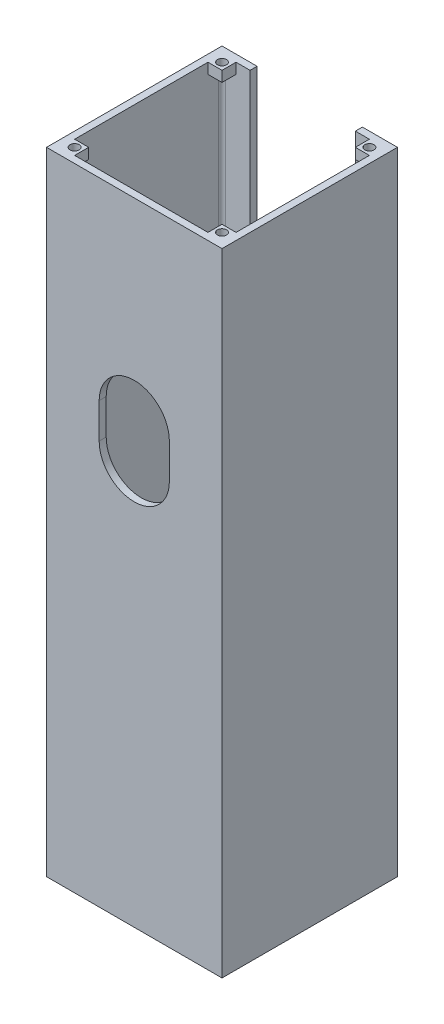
ISO-10303-21;
HEADER;
FILE_DESCRIPTION(('STEP AP214'),'2;1');
FILE_NAME('part.step','',(''),(''),'','','');
FILE_SCHEMA(('AUTOMOTIVE_DESIGN { 1 0 10303 214 1 1 1 1 }'));
ENDSEC;
DATA;
#1=APPLICATION_CONTEXT('core data for automotive mechanical design processes');
#2=APPLICATION_PROTOCOL_DEFINITION('international standard','automotive_design',2000,#1);
#3=PRODUCT_CONTEXT('',#1,'mechanical');
#4=PRODUCT('Part','Part','',(#3));
#5=PRODUCT_RELATED_PRODUCT_CATEGORY('part','',(#4));
#6=PRODUCT_DEFINITION_FORMATION('','',#4);
#7=PRODUCT_DEFINITION_CONTEXT('part definition',#1,'design');
#8=PRODUCT_DEFINITION('design','',#6,#7);
#9=PRODUCT_DEFINITION_SHAPE('','',#8);
#10=(LENGTH_UNIT() NAMED_UNIT(*) SI_UNIT(.MILLI.,.METRE.));
#11=(NAMED_UNIT(*) PLANE_ANGLE_UNIT() SI_UNIT($,.RADIAN.));
#12=(NAMED_UNIT(*) SI_UNIT($,.STERADIAN.) SOLID_ANGLE_UNIT());
#13=UNCERTAINTY_MEASURE_WITH_UNIT(LENGTH_MEASURE(1.E-05),#10,'distance_accuracy_value','');
#14=(GEOMETRIC_REPRESENTATION_CONTEXT(3) GLOBAL_UNCERTAINTY_ASSIGNED_CONTEXT((#13)) GLOBAL_UNIT_ASSIGNED_CONTEXT((#10,
#11,#12)) REPRESENTATION_CONTEXT('',''));
#15=CARTESIAN_POINT('',(0.,0.,0.));
#16=DIRECTION('',(0.,0.,1.));
#17=DIRECTION('',(1.,0.,0.));
#18=AXIS2_PLACEMENT_3D('',#15,#16,#17);
#19=CARTESIAN_POINT('',(0.,-302.26,-2.54));
#20=DIRECTION('',(0.,0.,1.));
#21=DIRECTION('',(1.,0.,0.));
#22=AXIS2_PLACEMENT_3D('',#19,#20,#21);
#23=PLANE('',#22);
#24=DIRECTION('',(0.,-1.,0.));
#25=VECTOR('',#24,1.);
#26=CARTESIAN_POINT('',(44.45,0.,-2.54));
#27=LINE('',#26,#25);
#28=CARTESIAN_POINT('',(44.45,-146.05,-2.54));
#29=VERTEX_POINT('',#28);
#30=CARTESIAN_POINT('',(44.45,-158.75,-2.54));
#31=VERTEX_POINT('',#30);
#32=EDGE_CURVE('E512',#29,#31,#27,.T.);
#33=ORIENTED_EDGE('',*,*,#32,.F.);
#34=CARTESIAN_POINT('',(31.75,-146.05,-2.54));
#35=DIRECTION('',(0.,0.,1.));
#36=DIRECTION('',(1.,0.,0.));
#37=AXIS2_PLACEMENT_3D('',#34,#35,#36);
#38=CIRCLE('',#37,12.7);
#39=CARTESIAN_POINT('',(19.05,-146.05,-2.54));
#40=VERTEX_POINT('',#39);
#41=EDGE_CURVE('E487',#29,#40,#38,.T.);
#42=ORIENTED_EDGE('',*,*,#41,.T.);
#43=DIRECTION('',(0.,-1.,0.));
#44=VECTOR('',#43,1.);
#45=CARTESIAN_POINT('',(19.05,0.,-2.54));
#46=LINE('',#45,#44);
#47=CARTESIAN_POINT('',(19.05,-158.75,-2.54));
#48=VERTEX_POINT('',#47);
#49=EDGE_CURVE('E503',#40,#48,#46,.T.);
#50=ORIENTED_EDGE('',*,*,#49,.T.);
#51=CARTESIAN_POINT('',(31.75,-158.75,-2.54));
#52=DIRECTION('',(0.,0.,1.));
#53=DIRECTION('',(1.,0.,0.));
#54=AXIS2_PLACEMENT_3D('',#51,#52,#53);
#55=CIRCLE('',#54,12.7);
#56=EDGE_CURVE('E507',#48,#31,#55,.T.);
#57=ORIENTED_EDGE('',*,*,#56,.T.);
#58=EDGE_LOOP('',(#33,#42,#50,#57));
#59=FACE_BOUND('',#58,.T.);
#60=DIRECTION('',(0.,1.,0.));
#61=VECTOR('',#60,1.);
#62=CARTESIAN_POINT('',(55.88,-80.01,-2.54));
#63=LINE('',#62,#61);
#64=CARTESIAN_POINT('',(55.88,-80.01,-2.54));
#65=VERTEX_POINT('',#64);
#66=CARTESIAN_POINT('',(55.88,-76.2,-2.54));
#67=VERTEX_POINT('',#66);
#68=EDGE_CURVE('E68',#65,#67,#63,.T.);
#69=ORIENTED_EDGE('',*,*,#68,.F.);
#70=DIRECTION('',(-1.,0.,0.));
#71=VECTOR('',#70,1.);
#72=CARTESIAN_POINT('',(60.96,-80.01,-2.54));
#73=LINE('',#72,#71);
#74=CARTESIAN_POINT('',(59.69,-80.01,-2.54));
#75=VERTEX_POINT('',#74);
#76=EDGE_CURVE('E289',#75,#65,#73,.T.);
#77=ORIENTED_EDGE('',*,*,#76,.F.);
#78=DIRECTION('',(0.,1.,0.));
#79=VECTOR('',#78,1.);
#80=CARTESIAN_POINT('',(59.69,-302.26,-2.54));
#81=LINE('',#80,#79);
#82=CARTESIAN_POINT('',(59.69,-302.26,-2.54));
#83=VERTEX_POINT('',#82);
#84=EDGE_CURVE('E568',#75,#83,#81,.F.);
#85=ORIENTED_EDGE('',*,*,#84,.T.);
#86=DIRECTION('',(1.,0.,0.));
#87=VECTOR('',#86,1.);
#88=CARTESIAN_POINT('',(0.,-302.26,-2.54));
#89=LINE('',#88,#87);
#90=CARTESIAN_POINT('',(3.81,-302.26,-2.54));
#91=VERTEX_POINT('',#90);
#92=EDGE_CURVE('E529',#91,#83,#89,.T.);
#93=ORIENTED_EDGE('',*,*,#92,.F.);
#94=DIRECTION('',(0.,1.,0.));
#95=VECTOR('',#94,1.);
#96=CARTESIAN_POINT('',(3.81,-302.26,-2.54));
#97=LINE('',#96,#95);
#98=CARTESIAN_POINT('',(3.81,-80.01,-2.54));
#99=VERTEX_POINT('',#98);
#100=EDGE_CURVE('E582',#91,#99,#97,.T.);
#101=ORIENTED_EDGE('',*,*,#100,.T.);
#102=DIRECTION('',(-1.,0.,0.));
#103=VECTOR('',#102,1.);
#104=CARTESIAN_POINT('',(0.,-80.01,-2.54));
#105=LINE('',#104,#103);
#106=CARTESIAN_POINT('',(7.62,-80.01,-2.54));
#107=VERTEX_POINT('',#106);
#108=EDGE_CURVE('E332',#107,#99,#105,.T.);
#109=ORIENTED_EDGE('',*,*,#108,.F.);
#110=DIRECTION('',(0.,1.,0.));
#111=VECTOR('',#110,1.);
#112=CARTESIAN_POINT('',(7.62,-80.01,-2.54));
#113=LINE('',#112,#111);
#114=CARTESIAN_POINT('',(7.62,-76.2,-2.54));
#115=VERTEX_POINT('',#114);
#116=EDGE_CURVE('E299',#107,#115,#113,.T.);
#117=ORIENTED_EDGE('',*,*,#116,.T.);
#118=DIRECTION('',(1.,0.,0.));
#119=VECTOR('',#118,1.);
#120=CARTESIAN_POINT('',(0.,-76.2,-2.54));
#121=LINE('',#120,#119);
#122=EDGE_CURVE('E440',#115,#67,#121,.T.);
#123=ORIENTED_EDGE('',*,*,#122,.T.);
#124=EDGE_LOOP('',(#69,#77,#85,#93,#101,#109,#117,#123));
#125=FACE_BOUND('',#124,.T.);
#126=ADVANCED_FACE('F44',(#59,#125),#23,.F.);
#127=CARTESIAN_POINT('',(59.69,-302.26,-3.81));
#128=DIRECTION('',(0.,-1.,0.));
#129=DIRECTION('',(0.,0.,-1.));
#130=AXIS2_PLACEMENT_3D('',#127,#128,#129);
#131=CYLINDRICAL_SURFACE('',#130,1.27);
#132=CARTESIAN_POINT('',(59.69,-80.01,-3.81));
#133=DIRECTION('',(0.,1.,0.));
#134=DIRECTION('',(0.,0.,1.));
#135=AXIS2_PLACEMENT_3D('',#132,#133,#134);
#136=CIRCLE('',#135,1.27);
#137=CARTESIAN_POINT('',(60.96,-80.01,-3.81));
#138=VERTEX_POINT('',#137);
#139=EDGE_CURVE('E11',#138,#75,#136,.F.);
#140=ORIENTED_EDGE('',*,*,#139,.F.);
#141=DIRECTION('',(0.,1.,0.));
#142=VECTOR('',#141,1.);
#143=CARTESIAN_POINT('',(60.96,-2.53999999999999,-3.81));
#144=LINE('',#143,#142);
#145=CARTESIAN_POINT('',(60.96,-302.26,-3.81));
#146=VERTEX_POINT('',#145);
#147=EDGE_CURVE('E612',#146,#138,#144,.T.);
#148=ORIENTED_EDGE('',*,*,#147,.F.);
#149=CARTESIAN_POINT('',(59.69,-302.26,-3.81));
#150=DIRECTION('',(0.,1.,0.));
#151=DIRECTION('',(0.,0.,1.));
#152=AXIS2_PLACEMENT_3D('',#149,#150,#151);
#153=CIRCLE('',#152,1.27);
#154=EDGE_CURVE('E593',#83,#146,#153,.T.);
#155=ORIENTED_EDGE('',*,*,#154,.F.);
#156=ORIENTED_EDGE('',*,*,#84,.F.);
#157=EDGE_LOOP('',(#140,#148,#155,#156));
#158=FACE_BOUND('',#157,.T.);
#159=ADVANCED_FACE('F46',(#158),#131,.F.);
#160=CARTESIAN_POINT('',(2.54,-302.26,0.));
#161=DIRECTION('',(1.,0.,0.));
#162=DIRECTION('',(0.,0.,-1.));
#163=AXIS2_PLACEMENT_3D('',#160,#161,#162);
#164=PLANE('',#163);
#165=DIRECTION('',(0.,0.,-1.));
#166=VECTOR('',#165,1.);
#167=CARTESIAN_POINT('',(2.54,-76.2,0.));
#168=LINE('',#167,#166);
#169=CARTESIAN_POINT('',(2.54,-76.2,-7.62));
#170=VERTEX_POINT('',#169);
#171=CARTESIAN_POINT('',(2.54,-76.2,-55.88));
#172=VERTEX_POINT('',#171);
#173=EDGE_CURVE('E443',#170,#172,#168,.T.);
#174=ORIENTED_EDGE('',*,*,#173,.F.);
#175=DIRECTION('',(0.,1.,0.));
#176=VECTOR('',#175,1.);
#177=CARTESIAN_POINT('',(2.54,-80.01,-7.62));
#178=LINE('',#177,#176);
#179=CARTESIAN_POINT('',(2.54,-80.01,-7.62));
#180=VERTEX_POINT('',#179);
#181=EDGE_CURVE('E281',#180,#170,#178,.T.);
#182=ORIENTED_EDGE('',*,*,#181,.F.);
#183=DIRECTION('',(0.,0.,-1.));
#184=VECTOR('',#183,1.);
#185=CARTESIAN_POINT('',(2.54,-80.01,0.));
#186=LINE('',#185,#184);
#187=CARTESIAN_POINT('',(2.54,-80.01,-3.81));
#188=VERTEX_POINT('',#187);
#189=EDGE_CURVE('E322',#188,#180,#186,.T.);
#190=ORIENTED_EDGE('',*,*,#189,.F.);
#191=DIRECTION('',(0.,1.,0.));
#192=VECTOR('',#191,1.);
#193=CARTESIAN_POINT('',(2.54,-302.26,-3.81));
#194=LINE('',#193,#192);
#195=CARTESIAN_POINT('',(2.54,-302.26,-3.81));
#196=VERTEX_POINT('',#195);
#197=EDGE_CURVE('E590',#188,#196,#194,.F.);
#198=ORIENTED_EDGE('',*,*,#197,.T.);
#199=DIRECTION('',(0.,0.,-1.));
#200=VECTOR('',#199,1.);
#201=CARTESIAN_POINT('',(2.54,-302.26,0.));
#202=LINE('',#201,#200);
#203=CARTESIAN_POINT('',(2.54,-302.26,-59.69));
#204=VERTEX_POINT('',#203);
#205=EDGE_CURVE('E543',#196,#204,#202,.T.);
#206=ORIENTED_EDGE('',*,*,#205,.T.);
#207=DIRECTION('',(0.,1.,0.));
#208=VECTOR('',#207,1.);
#209=CARTESIAN_POINT('',(2.54,-2.53999999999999,-59.69));
#210=LINE('',#209,#208);
#211=CARTESIAN_POINT('',(2.54,-80.01,-59.69));
#212=VERTEX_POINT('',#211);
#213=EDGE_CURVE('E586',#204,#212,#210,.T.);
#214=ORIENTED_EDGE('',*,*,#213,.T.);
#215=DIRECTION('',(0.,0.,-1.));
#216=VECTOR('',#215,1.);
#217=CARTESIAN_POINT('',(2.54,-80.01,0.));
#218=LINE('',#217,#216);
#219=CARTESIAN_POINT('',(2.54,-80.01,-55.88));
#220=VERTEX_POINT('',#219);
#221=EDGE_CURVE('E397',#220,#212,#218,.T.);
#222=ORIENTED_EDGE('',*,*,#221,.F.);
#223=DIRECTION('',(0.,1.,0.));
#224=VECTOR('',#223,1.);
#225=CARTESIAN_POINT('',(2.54,-80.01,-55.88));
#226=LINE('',#225,#224);
#227=EDGE_CURVE('E419',#220,#172,#226,.T.);
#228=ORIENTED_EDGE('',*,*,#227,.T.);
#229=EDGE_LOOP('',(#174,#182,#190,#198,#206,#214,#222,#228));
#230=FACE_BOUND('',#229,.T.);
#231=ADVANCED_FACE('F697',(#230),#164,.T.);
#232=CARTESIAN_POINT('',(3.81,-302.26,-3.81));
#233=DIRECTION('',(0.,1.,0.));
#234=DIRECTION('',(0.,0.,1.));
#235=AXIS2_PLACEMENT_3D('',#232,#233,#234);
#236=CYLINDRICAL_SURFACE('',#235,1.27);
#237=CARTESIAN_POINT('',(3.81,-80.01,-3.81));
#238=DIRECTION('',(0.,1.,0.));
#239=DIRECTION('',(0.,0.,1.));
#240=AXIS2_PLACEMENT_3D('',#237,#238,#239);
#241=CIRCLE('',#240,1.27);
#242=EDGE_CURVE('E303',#99,#188,#241,.F.);
#243=ORIENTED_EDGE('',*,*,#242,.F.);
#244=ORIENTED_EDGE('',*,*,#100,.F.);
#245=CARTESIAN_POINT('',(3.81,-302.26,-3.81));
#246=DIRECTION('',(0.,1.,0.));
#247=DIRECTION('',(0.,0.,1.));
#248=AXIS2_PLACEMENT_3D('',#245,#246,#247);
#249=CIRCLE('',#248,1.27);
#250=EDGE_CURVE('E602',#196,#91,#249,.T.);
#251=ORIENTED_EDGE('',*,*,#250,.F.);
#252=ORIENTED_EDGE('',*,*,#197,.F.);
#253=EDGE_LOOP('',(#243,#244,#251,#252));
#254=FACE_BOUND('',#253,.T.);
#255=ADVANCED_FACE('F702',(#254),#236,.F.);
#256=CARTESIAN_POINT('',(60.96,-302.26,0.));
#257=DIRECTION('',(1.,0.,0.));
#258=DIRECTION('',(0.,0.,-1.));
#259=AXIS2_PLACEMENT_3D('',#256,#257,#258);
#260=PLANE('',#259);
#261=DIRECTION('',(0.,0.,-1.));
#262=VECTOR('',#261,1.);
#263=CARTESIAN_POINT('',(60.96,-80.01,-2.54));
#264=LINE('',#263,#262);
#265=CARTESIAN_POINT('',(60.96,-80.01,-7.62000000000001));
#266=VERTEX_POINT('',#265);
#267=EDGE_CURVE('E60',#138,#266,#264,.T.);
#268=ORIENTED_EDGE('',*,*,#267,.T.);
#269=DIRECTION('',(0.,1.,0.));
#270=VECTOR('',#269,1.);
#271=CARTESIAN_POINT('',(60.96,-80.01,-7.62000000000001));
#272=LINE('',#271,#270);
#273=CARTESIAN_POINT('',(60.96,-76.2,-7.62000000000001));
#274=VERTEX_POINT('',#273);
#275=EDGE_CURVE('E266',#266,#274,#272,.T.);
#276=ORIENTED_EDGE('',*,*,#275,.T.);
#277=DIRECTION('',(0.,0.,-1.));
#278=VECTOR('',#277,1.);
#279=CARTESIAN_POINT('',(60.96,-76.2,0.));
#280=LINE('',#279,#278);
#281=CARTESIAN_POINT('',(60.96,-76.2,-55.88));
#282=VERTEX_POINT('',#281);
#283=EDGE_CURVE('E279',#274,#282,#280,.T.);
#284=ORIENTED_EDGE('',*,*,#283,.T.);
#285=DIRECTION('',(0.,1.,0.));
#286=VECTOR('',#285,1.);
#287=CARTESIAN_POINT('',(60.96,-80.01,-55.88));
#288=LINE('',#287,#286);
#289=CARTESIAN_POINT('',(60.96,-80.01,-55.88));
#290=VERTEX_POINT('',#289);
#291=EDGE_CURVE('E319',#290,#282,#288,.T.);
#292=ORIENTED_EDGE('',*,*,#291,.F.);
#293=DIRECTION('',(0.,0.,1.));
#294=VECTOR('',#293,1.);
#295=CARTESIAN_POINT('',(60.96,-80.01,0.));
#296=LINE('',#295,#294);
#297=CARTESIAN_POINT('',(60.96,-80.01,-59.69));
#298=VERTEX_POINT('',#297);
#299=EDGE_CURVE('E365',#298,#290,#296,.T.);
#300=ORIENTED_EDGE('',*,*,#299,.F.);
#301=DIRECTION('',(0.,1.,0.));
#302=VECTOR('',#301,1.);
#303=CARTESIAN_POINT('',(60.96,-302.26,-59.69));
#304=LINE('',#303,#302);
#305=CARTESIAN_POINT('',(60.96,-302.26,-59.69));
#306=VERTEX_POINT('',#305);
#307=EDGE_CURVE('E53',#298,#306,#304,.F.);
#308=ORIENTED_EDGE('',*,*,#307,.T.);
#309=DIRECTION('',(0.,0.,-1.));
#310=VECTOR('',#309,1.);
#311=CARTESIAN_POINT('',(60.96,-302.26,0.));
#312=LINE('',#311,#310);
#313=EDGE_CURVE('E535',#146,#306,#312,.T.);
#314=ORIENTED_EDGE('',*,*,#313,.F.);
#315=ORIENTED_EDGE('',*,*,#147,.T.);
#316=EDGE_LOOP('',(#268,#276,#284,#292,#300,#308,#314,#315));
#317=FACE_BOUND('',#316,.T.);
#318=ADVANCED_FACE('F617',(#317),#260,.F.);
#319=CARTESIAN_POINT('',(59.69,-302.26,-59.69));
#320=DIRECTION('',(0.,1.,0.));
#321=DIRECTION('',(0.,0.,1.));
#322=AXIS2_PLACEMENT_3D('',#319,#320,#321);
#323=CYLINDRICAL_SURFACE('',#322,1.27);
#324=CARTESIAN_POINT('',(59.69,-80.01,-59.69));
#325=DIRECTION('',(0.,1.,0.));
#326=DIRECTION('',(0.,0.,1.));
#327=AXIS2_PLACEMENT_3D('',#324,#325,#326);
#328=CIRCLE('',#327,1.27);
#329=CARTESIAN_POINT('',(59.69,-80.01,-60.96));
#330=VERTEX_POINT('',#329);
#331=EDGE_CURVE('E341',#330,#298,#328,.F.);
#332=ORIENTED_EDGE('',*,*,#331,.F.);
#333=DIRECTION('',(0.,1.,0.));
#334=VECTOR('',#333,1.);
#335=CARTESIAN_POINT('',(59.69,-302.26,-60.96));
#336=LINE('',#335,#334);
#337=CARTESIAN_POINT('',(59.69,-302.26,-60.96));
#338=VERTEX_POINT('',#337);
#339=EDGE_CURVE('E605',#338,#330,#336,.T.);
#340=ORIENTED_EDGE('',*,*,#339,.F.);
#341=CARTESIAN_POINT('',(59.69,-302.26,-59.69));
#342=DIRECTION('',(0.,1.,0.));
#343=DIRECTION('',(0.,0.,1.));
#344=AXIS2_PLACEMENT_3D('',#341,#342,#343);
#345=CIRCLE('',#344,1.27);
#346=EDGE_CURVE('E596',#306,#338,#345,.T.);
#347=ORIENTED_EDGE('',*,*,#346,.F.);
#348=ORIENTED_EDGE('',*,*,#307,.F.);
#349=EDGE_LOOP('',(#332,#340,#347,#348));
#350=FACE_BOUND('',#349,.T.);
#351=ADVANCED_FACE('F627',(#350),#323,.F.);
#352=CARTESIAN_POINT('',(0.,-302.26,-60.96));
#353=DIRECTION('',(0.,0.,1.));
#354=DIRECTION('',(1.,0.,0.));
#355=AXIS2_PLACEMENT_3D('',#352,#353,#354);
#356=PLANE('',#355);
#357=DIRECTION('',(0.,1.,0.));
#358=VECTOR('',#357,1.);
#359=CARTESIAN_POINT('',(55.88,-80.01,-60.96));
#360=LINE('',#359,#358);
#361=CARTESIAN_POINT('',(55.88,-80.01,-60.96));
#362=VERTEX_POINT('',#361);
#363=CARTESIAN_POINT('',(55.88,-76.2,-60.96));
#364=VERTEX_POINT('',#363);
#365=EDGE_CURVE('E338',#362,#364,#360,.T.);
#366=ORIENTED_EDGE('',*,*,#365,.T.);
#367=DIRECTION('',(1.,0.,0.));
#368=VECTOR('',#367,1.);
#369=CARTESIAN_POINT('',(0.,-76.2,-60.96));
#370=LINE('',#369,#368);
#371=CARTESIAN_POINT('',(50.8,-76.2,-60.96));
#372=VERTEX_POINT('',#371);
#373=EDGE_CURVE('E446',#372,#364,#370,.T.);
#374=ORIENTED_EDGE('',*,*,#373,.F.);
#375=DIRECTION('',(0.,-1.,0.));
#376=VECTOR('',#375,1.);
#377=CARTESIAN_POINT('',(50.8,0.,-60.96));
#378=LINE('',#377,#376);
#379=CARTESIAN_POINT('',(50.8,-292.1,-60.96));
#380=VERTEX_POINT('',#379);
#381=EDGE_CURVE('E459',#372,#380,#378,.T.);
#382=ORIENTED_EDGE('',*,*,#381,.T.);
#383=DIRECTION('',(1.,0.,0.));
#384=VECTOR('',#383,1.);
#385=CARTESIAN_POINT('',(0.,-292.1,-60.96));
#386=LINE('',#385,#384);
#387=CARTESIAN_POINT('',(12.7,-292.1,-60.96));
#388=VERTEX_POINT('',#387);
#389=EDGE_CURVE('E462',#388,#380,#386,.T.);
#390=ORIENTED_EDGE('',*,*,#389,.F.);
#391=DIRECTION('',(0.,-1.,0.));
#392=VECTOR('',#391,1.);
#393=CARTESIAN_POINT('',(12.7,0.,-60.96));
#394=LINE('',#393,#392);
#395=CARTESIAN_POINT('',(12.7,-76.2,-60.96));
#396=VERTEX_POINT('',#395);
#397=EDGE_CURVE('E467',#396,#388,#394,.T.);
#398=ORIENTED_EDGE('',*,*,#397,.F.);
#399=CARTESIAN_POINT('',(7.62,-76.2,-60.96));
#400=VERTEX_POINT('',#399);
#401=EDGE_CURVE('E451',#400,#396,#370,.T.);
#402=ORIENTED_EDGE('',*,*,#401,.F.);
#403=DIRECTION('',(0.,1.,0.));
#404=VECTOR('',#403,1.);
#405=CARTESIAN_POINT('',(7.62,-80.01,-60.96));
#406=LINE('',#405,#404);
#407=CARTESIAN_POINT('',(7.62,-80.01,-60.96));
#408=VERTEX_POINT('',#407);
#409=EDGE_CURVE('E404',#408,#400,#406,.T.);
#410=ORIENTED_EDGE('',*,*,#409,.F.);
#411=DIRECTION('',(1.,0.,0.));
#412=VECTOR('',#411,1.);
#413=CARTESIAN_POINT('',(0.,-80.01,-60.96));
#414=LINE('',#413,#412);
#415=CARTESIAN_POINT('',(3.81,-80.01,-60.96));
#416=VERTEX_POINT('',#415);
#417=EDGE_CURVE('E391',#416,#408,#414,.T.);
#418=ORIENTED_EDGE('',*,*,#417,.F.);
#419=DIRECTION('',(0.,1.,0.));
#420=VECTOR('',#419,1.);
#421=CARTESIAN_POINT('',(3.81,-302.26,-60.96));
#422=LINE('',#421,#420);
#423=CARTESIAN_POINT('',(3.81,-302.26,-60.96));
#424=VERTEX_POINT('',#423);
#425=EDGE_CURVE('E609',#416,#424,#422,.F.);
#426=ORIENTED_EDGE('',*,*,#425,.T.);
#427=DIRECTION('',(1.,0.,0.));
#428=VECTOR('',#427,1.);
#429=CARTESIAN_POINT('',(0.,-302.26,-60.96));
#430=LINE('',#429,#428);
#431=EDGE_CURVE('E539',#424,#338,#430,.T.);
#432=ORIENTED_EDGE('',*,*,#431,.T.);
#433=ORIENTED_EDGE('',*,*,#339,.T.);
#434=DIRECTION('',(1.,0.,0.));
#435=VECTOR('',#434,1.);
#436=CARTESIAN_POINT('',(0.,-80.01,-60.96));
#437=LINE('',#436,#435);
#438=EDGE_CURVE('E376',#362,#330,#437,.T.);
#439=ORIENTED_EDGE('',*,*,#438,.F.);
#440=EDGE_LOOP('',(#366,#374,#382,#390,#398,#402,#410,#418,#426,#432,#433,#439));
#441=FACE_BOUND('',#440,.T.);
#442=ADVANCED_FACE('F629',(#441),#356,.T.);
#443=CARTESIAN_POINT('',(3.81,-302.26,-59.69));
#444=DIRECTION('',(0.,-1.,0.));
#445=DIRECTION('',(0.,0.,-1.));
#446=AXIS2_PLACEMENT_3D('',#443,#444,#445);
#447=CYLINDRICAL_SURFACE('',#446,1.27);
#448=CARTESIAN_POINT('',(3.81,-80.01,-59.69));
#449=DIRECTION('',(0.,1.,0.));
#450=DIRECTION('',(0.,0.,1.));
#451=AXIS2_PLACEMENT_3D('',#448,#449,#450);
#452=CIRCLE('',#451,1.27);
#453=EDGE_CURVE('E394',#212,#416,#452,.F.);
#454=ORIENTED_EDGE('',*,*,#453,.F.);
#455=ORIENTED_EDGE('',*,*,#213,.F.);
#456=CARTESIAN_POINT('',(3.81,-302.26,-59.69));
#457=DIRECTION('',(0.,1.,0.));
#458=DIRECTION('',(0.,0.,1.));
#459=AXIS2_PLACEMENT_3D('',#456,#457,#458);
#460=CIRCLE('',#459,1.27);
#461=EDGE_CURVE('E599',#424,#204,#460,.T.);
#462=ORIENTED_EDGE('',*,*,#461,.F.);
#463=ORIENTED_EDGE('',*,*,#425,.F.);
#464=EDGE_LOOP('',(#454,#455,#462,#463));
#465=FACE_BOUND('',#464,.T.);
#466=ADVANCED_FACE('F705',(#465),#447,.F.);
#467=CARTESIAN_POINT('',(0.,-304.8,0.));
#468=DIRECTION('',(0.,0.,1.));
#469=DIRECTION('',(1.,0.,0.));
#470=AXIS2_PLACEMENT_3D('',#467,#468,#469);
#471=PLANE('',#470);
#472=DIRECTION('',(1.,0.,0.));
#473=VECTOR('',#472,1.);
#474=CARTESIAN_POINT('',(0.,-76.2,0.));
#475=LINE('',#474,#473);
#476=CARTESIAN_POINT('',(0.,-76.2,0.));
#477=VERTEX_POINT('',#476);
#478=CARTESIAN_POINT('',(63.5,-76.2,0.));
#479=VERTEX_POINT('',#478);
#480=EDGE_CURVE('E428',#477,#479,#475,.T.);
#481=ORIENTED_EDGE('',*,*,#480,.F.);
#482=DIRECTION('',(0.,1.,0.));
#483=VECTOR('',#482,1.);
#484=CARTESIAN_POINT('',(0.,-304.8,0.));
#485=LINE('',#484,#483);
#486=CARTESIAN_POINT('',(0.,-304.8,0.));
#487=VERTEX_POINT('',#486);
#488=EDGE_CURVE('E563',#487,#477,#485,.T.);
#489=ORIENTED_EDGE('',*,*,#488,.F.);
#490=DIRECTION('',(1.,0.,0.));
#491=VECTOR('',#490,1.);
#492=CARTESIAN_POINT('',(0.,-304.8,0.));
#493=LINE('',#492,#491);
#494=CARTESIAN_POINT('',(63.5,-304.8,0.));
#495=VERTEX_POINT('',#494);
#496=EDGE_CURVE('E551',#487,#495,#493,.T.);
#497=ORIENTED_EDGE('',*,*,#496,.T.);
#498=DIRECTION('',(0.,1.,0.));
#499=VECTOR('',#498,1.);
#500=CARTESIAN_POINT('',(63.5,-304.8,0.));
#501=LINE('',#500,#499);
#502=EDGE_CURVE('E573',#495,#479,#501,.T.);
#503=ORIENTED_EDGE('',*,*,#502,.T.);
#504=EDGE_LOOP('',(#481,#489,#497,#503));
#505=FACE_BOUND('',#504,.T.);
#506=CARTESIAN_POINT('',(31.75,-146.05,0.));
#507=DIRECTION('',(0.,0.,1.));
#508=DIRECTION('',(1.,0.,0.));
#509=AXIS2_PLACEMENT_3D('',#506,#507,#508);
#510=CIRCLE('',#509,12.7);
#511=CARTESIAN_POINT('',(44.45,-146.05,0.));
#512=VERTEX_POINT('',#511);
#513=CARTESIAN_POINT('',(19.05,-146.05,0.));
#514=VERTEX_POINT('',#513);
#515=EDGE_CURVE('E483',#512,#514,#510,.T.);
#516=ORIENTED_EDGE('',*,*,#515,.F.);
#517=DIRECTION('',(0.,-1.,0.));
#518=VECTOR('',#517,1.);
#519=CARTESIAN_POINT('',(44.45,0.,0.));
#520=LINE('',#519,#518);
#521=CARTESIAN_POINT('',(44.45,-158.75,0.));
#522=VERTEX_POINT('',#521);
#523=EDGE_CURVE('E508',#512,#522,#520,.T.);
#524=ORIENTED_EDGE('',*,*,#523,.T.);
#525=CARTESIAN_POINT('',(31.75,-158.75,0.));
#526=DIRECTION('',(0.,0.,1.));
#527=DIRECTION('',(1.,0.,0.));
#528=AXIS2_PLACEMENT_3D('',#525,#526,#527);
#529=CIRCLE('',#528,12.7);
#530=CARTESIAN_POINT('',(19.05,-158.75,0.));
#531=VERTEX_POINT('',#530);
#532=EDGE_CURVE('E519',#531,#522,#529,.T.);
#533=ORIENTED_EDGE('',*,*,#532,.F.);
#534=DIRECTION('',(0.,-1.,0.));
#535=VECTOR('',#534,1.);
#536=CARTESIAN_POINT('',(19.05,0.,0.));
#537=LINE('',#536,#535);
#538=EDGE_CURVE('E499',#514,#531,#537,.T.);
#539=ORIENTED_EDGE('',*,*,#538,.F.);
#540=EDGE_LOOP('',(#516,#524,#533,#539));
#541=FACE_BOUND('',#540,.T.);
#542=ADVANCED_FACE('F674',(#505,#541),#471,.T.);
#543=CARTESIAN_POINT('',(0.,-304.8,0.));
#544=DIRECTION('',(-1.,0.,0.));
#545=DIRECTION('',(0.,0.,1.));
#546=AXIS2_PLACEMENT_3D('',#543,#544,#545);
#547=PLANE('',#546);
#548=DIRECTION('',(0.,0.,1.));
#549=VECTOR('',#548,1.);
#550=CARTESIAN_POINT('',(0.,-76.2,0.));
#551=LINE('',#550,#549);
#552=CARTESIAN_POINT('',(0.,-76.2,-63.5));
#553=VERTEX_POINT('',#552);
#554=EDGE_CURVE('E418',#553,#477,#551,.T.);
#555=ORIENTED_EDGE('',*,*,#554,.F.);
#556=DIRECTION('',(0.,1.,0.));
#557=VECTOR('',#556,1.);
#558=CARTESIAN_POINT('',(0.,-304.8,-63.5));
#559=LINE('',#558,#557);
#560=CARTESIAN_POINT('',(0.,-304.8,-63.5));
#561=VERTEX_POINT('',#560);
#562=EDGE_CURVE('E564',#561,#553,#559,.T.);
#563=ORIENTED_EDGE('',*,*,#562,.F.);
#564=DIRECTION('',(0.,0.,1.));
#565=VECTOR('',#564,1.);
#566=CARTESIAN_POINT('',(0.,-304.8,0.));
#567=LINE('',#566,#565);
#568=EDGE_CURVE('E547',#561,#487,#567,.T.);
#569=ORIENTED_EDGE('',*,*,#568,.T.);
#570=ORIENTED_EDGE('',*,*,#488,.T.);
#571=EDGE_LOOP('',(#555,#563,#569,#570));
#572=FACE_BOUND('',#571,.T.);
#573=ADVANCED_FACE('F667',(#572),#547,.T.);
#574=CARTESIAN_POINT('',(0.,-304.8,-63.5));
#575=DIRECTION('',(0.,0.,-1.));
#576=DIRECTION('',(-1.,0.,0.));
#577=AXIS2_PLACEMENT_3D('',#574,#575,#576);
#578=PLANE('',#577);
#579=DIRECTION('',(-1.,0.,0.));
#580=VECTOR('',#579,1.);
#581=CARTESIAN_POINT('',(0.,-76.2,-63.5));
#582=LINE('',#581,#580);
#583=CARTESIAN_POINT('',(63.5,-76.2,-63.5));
#584=VERTEX_POINT('',#583);
#585=CARTESIAN_POINT('',(50.8,-76.2,-63.5));
#586=VERTEX_POINT('',#585);
#587=EDGE_CURVE('E435',#584,#586,#582,.T.);
#588=ORIENTED_EDGE('',*,*,#587,.F.);
#589=DIRECTION('',(0.,1.,0.));
#590=VECTOR('',#589,1.);
#591=CARTESIAN_POINT('',(63.5,-304.8,-63.5));
#592=LINE('',#591,#590);
#593=CARTESIAN_POINT('',(63.5,-304.8,-63.5));
#594=VERTEX_POINT('',#593);
#595=EDGE_CURVE('E569',#594,#584,#592,.T.);
#596=ORIENTED_EDGE('',*,*,#595,.F.);
#597=DIRECTION('',(-1.,0.,0.));
#598=VECTOR('',#597,1.);
#599=CARTESIAN_POINT('',(0.,-304.8,-63.5));
#600=LINE('',#599,#598);
#601=EDGE_CURVE('E559',#594,#561,#600,.T.);
#602=ORIENTED_EDGE('',*,*,#601,.T.);
#603=ORIENTED_EDGE('',*,*,#562,.T.);
#604=CARTESIAN_POINT('',(12.7,-76.2,-63.5));
#605=VERTEX_POINT('',#604);
#606=EDGE_CURVE('E434',#605,#553,#582,.T.);
#607=ORIENTED_EDGE('',*,*,#606,.F.);
#608=DIRECTION('',(0.,-1.,0.));
#609=VECTOR('',#608,1.);
#610=CARTESIAN_POINT('',(12.7,0.,-63.5));
#611=LINE('',#610,#609);
#612=CARTESIAN_POINT('',(12.7,-292.1,-63.5));
#613=VERTEX_POINT('',#612);
#614=EDGE_CURVE('E463',#605,#613,#611,.T.);
#615=ORIENTED_EDGE('',*,*,#614,.T.);
#616=DIRECTION('',(1.,0.,0.));
#617=VECTOR('',#616,1.);
#618=CARTESIAN_POINT('',(0.,-292.1,-63.5));
#619=LINE('',#618,#617);
#620=CARTESIAN_POINT('',(50.8,-292.1,-63.5));
#621=VERTEX_POINT('',#620);
#622=EDGE_CURVE('E473',#613,#621,#619,.T.);
#623=ORIENTED_EDGE('',*,*,#622,.T.);
#624=DIRECTION('',(0.,-1.,0.));
#625=VECTOR('',#624,1.);
#626=CARTESIAN_POINT('',(50.8,0.,-63.5));
#627=LINE('',#626,#625);
#628=EDGE_CURVE('E458',#586,#621,#627,.T.);
#629=ORIENTED_EDGE('',*,*,#628,.F.);
#630=EDGE_LOOP('',(#588,#596,#602,#603,#607,#615,#623,#629));
#631=FACE_BOUND('',#630,.T.);
#632=ADVANCED_FACE('F647',(#631),#578,.T.);
#633=CARTESIAN_POINT('',(63.5,-304.8,0.));
#634=DIRECTION('',(1.,0.,0.));
#635=DIRECTION('',(0.,0.,-1.));
#636=AXIS2_PLACEMENT_3D('',#633,#634,#635);
#637=PLANE('',#636);
#638=DIRECTION('',(0.,0.,-1.));
#639=VECTOR('',#638,1.);
#640=CARTESIAN_POINT('',(63.5,-76.2,0.));
#641=LINE('',#640,#639);
#642=EDGE_CURVE('E431',#479,#584,#641,.T.);
#643=ORIENTED_EDGE('',*,*,#642,.F.);
#644=ORIENTED_EDGE('',*,*,#502,.F.);
#645=DIRECTION('',(0.,0.,-1.));
#646=VECTOR('',#645,1.);
#647=CARTESIAN_POINT('',(63.5,-304.8,0.));
#648=LINE('',#647,#646);
#649=EDGE_CURVE('E555',#495,#594,#648,.T.);
#650=ORIENTED_EDGE('',*,*,#649,.T.);
#651=ORIENTED_EDGE('',*,*,#595,.T.);
#652=EDGE_LOOP('',(#643,#644,#650,#651));
#653=FACE_BOUND('',#652,.T.);
#654=ADVANCED_FACE('F678',(#653),#637,.T.);
#655=CARTESIAN_POINT('',(0.,-304.8,0.));
#656=DIRECTION('',(0.,-1.,0.));
#657=DIRECTION('',(0.,0.,-1.));
#658=AXIS2_PLACEMENT_3D('',#655,#656,#657);
#659=PLANE('',#658);
#660=ORIENTED_EDGE('',*,*,#568,.F.);
#661=ORIENTED_EDGE('',*,*,#601,.F.);
#662=ORIENTED_EDGE('',*,*,#649,.F.);
#663=ORIENTED_EDGE('',*,*,#496,.F.);
#664=EDGE_LOOP('',(#660,#661,#662,#663));
#665=FACE_BOUND('',#664,.T.);
#666=ADVANCED_FACE('F670',(#665),#659,.T.);
#667=CARTESIAN_POINT('',(0.,-302.26,0.));
#668=DIRECTION('',(0.,1.,0.));
#669=DIRECTION('',(0.,0.,1.));
#670=AXIS2_PLACEMENT_3D('',#667,#668,#669);
#671=PLANE('',#670);
#672=ORIENTED_EDGE('',*,*,#205,.F.);
#673=ORIENTED_EDGE('',*,*,#250,.T.);
#674=ORIENTED_EDGE('',*,*,#92,.T.);
#675=ORIENTED_EDGE('',*,*,#154,.T.);
#676=ORIENTED_EDGE('',*,*,#313,.T.);
#677=ORIENTED_EDGE('',*,*,#346,.T.);
#678=ORIENTED_EDGE('',*,*,#431,.F.);
#679=ORIENTED_EDGE('',*,*,#461,.T.);
#680=EDGE_LOOP('',(#672,#673,#674,#675,#676,#677,#678,#679));
#681=FACE_BOUND('',#680,.T.);
#682=ADVANCED_FACE('F623',(#681),#671,.T.);
#683=CARTESIAN_POINT('',(19.05,0.,-2.54));
#684=DIRECTION('',(-1.,0.,0.));
#685=DIRECTION('',(0.,0.,1.));
#686=AXIS2_PLACEMENT_3D('',#683,#684,#685);
#687=PLANE('',#686);
#688=ORIENTED_EDGE('',*,*,#538,.T.);
#689=DIRECTION('',(0.,0.,1.));
#690=VECTOR('',#689,1.);
#691=CARTESIAN_POINT('',(19.05,-158.75,-2.54));
#692=LINE('',#691,#690);
#693=EDGE_CURVE('E515',#48,#531,#692,.T.);
#694=ORIENTED_EDGE('',*,*,#693,.F.);
#695=ORIENTED_EDGE('',*,*,#49,.F.);
#696=DIRECTION('',(0.,0.,1.));
#697=VECTOR('',#696,1.);
#698=CARTESIAN_POINT('',(19.05,-146.05,-2.54));
#699=LINE('',#698,#697);
#700=EDGE_CURVE('E491',#40,#514,#699,.T.);
#701=ORIENTED_EDGE('',*,*,#700,.T.);
#702=EDGE_LOOP('',(#688,#694,#695,#701));
#703=FACE_BOUND('',#702,.T.);
#704=ADVANCED_FACE('F711',(#703),#687,.F.);
#705=CARTESIAN_POINT('',(44.45,0.,-2.54));
#706=DIRECTION('',(-1.,0.,0.));
#707=DIRECTION('',(0.,0.,1.));
#708=AXIS2_PLACEMENT_3D('',#705,#706,#707);
#709=PLANE('',#708);
#710=ORIENTED_EDGE('',*,*,#523,.F.);
#711=DIRECTION('',(0.,0.,1.));
#712=VECTOR('',#711,1.);
#713=CARTESIAN_POINT('',(44.45,-146.05,-2.54));
#714=LINE('',#713,#712);
#715=EDGE_CURVE('E495',#29,#512,#714,.T.);
#716=ORIENTED_EDGE('',*,*,#715,.F.);
#717=ORIENTED_EDGE('',*,*,#32,.T.);
#718=DIRECTION('',(0.,0.,1.));
#719=VECTOR('',#718,1.);
#720=CARTESIAN_POINT('',(44.45,-158.75,-2.54));
#721=LINE('',#720,#719);
#722=EDGE_CURVE('E526',#31,#522,#721,.T.);
#723=ORIENTED_EDGE('',*,*,#722,.T.);
#724=EDGE_LOOP('',(#710,#716,#717,#723));
#725=FACE_BOUND('',#724,.T.);
#726=ADVANCED_FACE('F714',(#725),#709,.T.);
#727=CARTESIAN_POINT('',(31.75,-158.75,-2.54));
#728=DIRECTION('',(0.,0.,1.));
#729=DIRECTION('',(1.,0.,0.));
#730=AXIS2_PLACEMENT_3D('',#727,#728,#729);
#731=CYLINDRICAL_SURFACE('',#730,12.7);
#732=ORIENTED_EDGE('',*,*,#532,.T.);
#733=ORIENTED_EDGE('',*,*,#722,.F.);
#734=ORIENTED_EDGE('',*,*,#56,.F.);
#735=ORIENTED_EDGE('',*,*,#693,.T.);
#736=EDGE_LOOP('',(#732,#733,#734,#735));
#737=FACE_BOUND('',#736,.T.);
#738=ADVANCED_FACE('F716',(#737),#731,.F.);
#739=CARTESIAN_POINT('',(31.75,-146.05,-2.54));
#740=DIRECTION('',(0.,0.,1.));
#741=DIRECTION('',(1.,0.,0.));
#742=AXIS2_PLACEMENT_3D('',#739,#740,#741);
#743=CYLINDRICAL_SURFACE('',#742,12.7);
#744=ORIENTED_EDGE('',*,*,#515,.T.);
#745=ORIENTED_EDGE('',*,*,#700,.F.);
#746=ORIENTED_EDGE('',*,*,#41,.F.);
#747=ORIENTED_EDGE('',*,*,#715,.T.);
#748=EDGE_LOOP('',(#744,#745,#746,#747));
#749=FACE_BOUND('',#748,.T.);
#750=ADVANCED_FACE('F719',(#749),#743,.F.);
#751=CARTESIAN_POINT('',(12.7,0.,-60.96));
#752=DIRECTION('',(1.,0.,0.));
#753=DIRECTION('',(0.,0.,-1.));
#754=AXIS2_PLACEMENT_3D('',#751,#752,#753);
#755=PLANE('',#754);
#756=DIRECTION('',(0.,0.,-1.));
#757=VECTOR('',#756,1.);
#758=CARTESIAN_POINT('',(12.7,-76.2,-60.96));
#759=LINE('',#758,#757);
#760=EDGE_CURVE('E455',#396,#605,#759,.T.);
#761=ORIENTED_EDGE('',*,*,#760,.F.);
#762=ORIENTED_EDGE('',*,*,#397,.T.);
#763=DIRECTION('',(0.,0.,-1.));
#764=VECTOR('',#763,1.);
#765=CARTESIAN_POINT('',(12.7,-292.1,-60.96));
#766=LINE('',#765,#764);
#767=EDGE_CURVE('E479',#388,#613,#766,.T.);
#768=ORIENTED_EDGE('',*,*,#767,.T.);
#769=ORIENTED_EDGE('',*,*,#614,.F.);
#770=EDGE_LOOP('',(#761,#762,#768,#769));
#771=FACE_BOUND('',#770,.T.);
#772=ADVANCED_FACE('F660',(#771),#755,.T.);
#773=CARTESIAN_POINT('',(0.,-292.1,-60.96));
#774=DIRECTION('',(0.,1.,0.));
#775=DIRECTION('',(0.,0.,1.));
#776=AXIS2_PLACEMENT_3D('',#773,#774,#775);
#777=PLANE('',#776);
#778=ORIENTED_EDGE('',*,*,#622,.F.);
#779=ORIENTED_EDGE('',*,*,#767,.F.);
#780=ORIENTED_EDGE('',*,*,#389,.T.);
#781=DIRECTION('',(0.,0.,-1.));
#782=VECTOR('',#781,1.);
#783=CARTESIAN_POINT('',(50.8,-292.1,-60.96));
#784=LINE('',#783,#782);
#785=EDGE_CURVE('E470',#380,#621,#784,.T.);
#786=ORIENTED_EDGE('',*,*,#785,.T.);
#787=EDGE_LOOP('',(#778,#779,#780,#786));
#788=FACE_BOUND('',#787,.T.);
#789=ADVANCED_FACE('F653',(#788),#777,.T.);
#790=CARTESIAN_POINT('',(50.8,0.,-60.96));
#791=DIRECTION('',(1.,0.,0.));
#792=DIRECTION('',(0.,0.,-1.));
#793=AXIS2_PLACEMENT_3D('',#790,#791,#792);
#794=PLANE('',#793);
#795=ORIENTED_EDGE('',*,*,#381,.F.);
#796=DIRECTION('',(0.,0.,-1.));
#797=VECTOR('',#796,1.);
#798=CARTESIAN_POINT('',(50.8,-76.2,-60.96));
#799=LINE('',#798,#797);
#800=EDGE_CURVE('E450',#372,#586,#799,.T.);
#801=ORIENTED_EDGE('',*,*,#800,.T.);
#802=ORIENTED_EDGE('',*,*,#628,.T.);
#803=ORIENTED_EDGE('',*,*,#785,.F.);
#804=EDGE_LOOP('',(#795,#801,#802,#803));
#805=FACE_BOUND('',#804,.T.);
#806=ADVANCED_FACE('F644',(#805),#794,.F.);
#807=CARTESIAN_POINT('',(0.,-76.2,0.));
#808=DIRECTION('',(0.,-1.,0.));
#809=DIRECTION('',(0.,0.,-1.));
#810=AXIS2_PLACEMENT_3D('',#807,#808,#809);
#811=PLANE('',#810);
#812=CARTESIAN_POINT('',(58.42,-76.2,-5.08));
#813=DIRECTION('',(0.,1.,0.));
#814=DIRECTION('',(0.,0.,1.));
#815=AXIS2_PLACEMENT_3D('',#812,#813,#814);
#816=CIRCLE('',#815,1.651);
#817=CARTESIAN_POINT('',(58.42,-76.2,-3.429));
#818=VERTEX_POINT('',#817);
#819=EDGE_CURVE('E800',#818,#818,#816,.T.);
#820=ORIENTED_EDGE('',*,*,#819,.F.);
#821=EDGE_LOOP('',(#820));
#822=FACE_BOUND('',#821,.T.);
#823=ORIENTED_EDGE('',*,*,#283,.F.);
#824=DIRECTION('',(-1.,0.,0.));
#825=VECTOR('',#824,1.);
#826=CARTESIAN_POINT('',(60.96,-76.2,-7.62000000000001));
#827=LINE('',#826,#825);
#828=CARTESIAN_POINT('',(55.88,-76.2,-7.62));
#829=VERTEX_POINT('',#828);
#830=EDGE_CURVE('E260',#274,#829,#827,.T.);
#831=ORIENTED_EDGE('',*,*,#830,.T.);
#832=DIRECTION('',(0.,0.,-1.));
#833=VECTOR('',#832,1.);
#834=CARTESIAN_POINT('',(55.88,-76.2,-2.54));
#835=LINE('',#834,#833);
#836=EDGE_CURVE('E269',#67,#829,#835,.T.);
#837=ORIENTED_EDGE('',*,*,#836,.F.);
#838=ORIENTED_EDGE('',*,*,#122,.F.);
#839=DIRECTION('',(0.,0.,-1.));
#840=VECTOR('',#839,1.);
#841=CARTESIAN_POINT('',(7.62,-76.2,0.));
#842=LINE('',#841,#840);
#843=CARTESIAN_POINT('',(7.62,-76.2,-7.62));
#844=VERTEX_POINT('',#843);
#845=EDGE_CURVE('E310',#115,#844,#842,.T.);
#846=ORIENTED_EDGE('',*,*,#845,.T.);
#847=DIRECTION('',(1.,0.,0.));
#848=VECTOR('',#847,1.);
#849=CARTESIAN_POINT('',(0.,-76.2,-7.62));
#850=LINE('',#849,#848);
#851=EDGE_CURVE('E306',#170,#844,#850,.T.);
#852=ORIENTED_EDGE('',*,*,#851,.F.);
#853=ORIENTED_EDGE('',*,*,#173,.T.);
#854=DIRECTION('',(1.,0.,0.));
#855=VECTOR('',#854,1.);
#856=CARTESIAN_POINT('',(0.,-76.2,-55.88));
#857=LINE('',#856,#855);
#858=CARTESIAN_POINT('',(7.62,-76.2,-55.88));
#859=VERTEX_POINT('',#858);
#860=EDGE_CURVE('E388',#172,#859,#857,.T.);
#861=ORIENTED_EDGE('',*,*,#860,.T.);
#862=DIRECTION('',(0.,0.,1.));
#863=VECTOR('',#862,1.);
#864=CARTESIAN_POINT('',(7.62,-76.2,0.));
#865=LINE('',#864,#863);
#866=EDGE_CURVE('E408',#400,#859,#865,.T.);
#867=ORIENTED_EDGE('',*,*,#866,.F.);
#868=ORIENTED_EDGE('',*,*,#401,.T.);
#869=ORIENTED_EDGE('',*,*,#760,.T.);
#870=ORIENTED_EDGE('',*,*,#606,.T.);
#871=ORIENTED_EDGE('',*,*,#554,.T.);
#872=ORIENTED_EDGE('',*,*,#480,.T.);
#873=ORIENTED_EDGE('',*,*,#642,.T.);
#874=ORIENTED_EDGE('',*,*,#587,.T.);
#875=ORIENTED_EDGE('',*,*,#800,.F.);
#876=ORIENTED_EDGE('',*,*,#373,.T.);
#877=DIRECTION('',(0.,0.,1.));
#878=VECTOR('',#877,1.);
#879=CARTESIAN_POINT('',(55.88,-76.2,0.));
#880=LINE('',#879,#878);
#881=CARTESIAN_POINT('',(55.88,-76.2,-55.88));
#882=VERTEX_POINT('',#881);
#883=EDGE_CURVE('E352',#364,#882,#880,.T.);
#884=ORIENTED_EDGE('',*,*,#883,.T.);
#885=DIRECTION('',(-1.,0.,0.));
#886=VECTOR('',#885,1.);
#887=CARTESIAN_POINT('',(0.,-76.2,-55.88));
#888=LINE('',#887,#886);
#889=EDGE_CURVE('E348',#282,#882,#888,.T.);
#890=ORIENTED_EDGE('',*,*,#889,.F.);
#891=EDGE_LOOP('',(#823,#831,#837,#838,#846,#852,#853,#861,#867,#868,#869,#870,#871,#872,#873,
#874,#875,#876,#884,#890));
#892=FACE_BOUND('',#891,.T.);
#893=CARTESIAN_POINT('',(5.08,-76.2,-58.42));
#894=DIRECTION('',(0.,1.,0.));
#895=DIRECTION('',(0.,0.,1.));
#896=AXIS2_PLACEMENT_3D('',#893,#894,#895);
#897=CIRCLE('',#896,1.651);
#898=CARTESIAN_POINT('',(5.08,-76.2,-56.769));
#899=VERTEX_POINT('',#898);
#900=EDGE_CURVE('E361',#899,#899,#897,.T.);
#901=ORIENTED_EDGE('',*,*,#900,.F.);
#902=EDGE_LOOP('',(#901));
#903=FACE_BOUND('',#902,.T.);
#904=CARTESIAN_POINT('',(58.42,-76.2,-58.42));
#905=DIRECTION('',(0.,1.,0.));
#906=DIRECTION('',(0.,0.,1.));
#907=AXIS2_PLACEMENT_3D('',#904,#905,#906);
#908=CIRCLE('',#907,1.651);
#909=CARTESIAN_POINT('',(58.42,-76.2,-56.769));
#910=VERTEX_POINT('',#909);
#911=EDGE_CURVE('E357',#910,#910,#908,.T.);
#912=ORIENTED_EDGE('',*,*,#911,.F.);
#913=EDGE_LOOP('',(#912));
#914=FACE_BOUND('',#913,.T.);
#915=CARTESIAN_POINT('',(5.08,-76.2,-5.08));
#916=DIRECTION('',(0.,1.,0.));
#917=DIRECTION('',(0.,0.,1.));
#918=AXIS2_PLACEMENT_3D('',#915,#916,#917);
#919=CIRCLE('',#918,1.651);
#920=CARTESIAN_POINT('',(5.08,-76.2,-3.429));
#921=VERTEX_POINT('',#920);
#922=EDGE_CURVE('E315',#921,#921,#919,.T.);
#923=ORIENTED_EDGE('',*,*,#922,.F.);
#924=EDGE_LOOP('',(#923));
#925=FACE_BOUND('',#924,.T.);
#926=ADVANCED_FACE('F276',(#822,#892,#903,#914,#925),#811,.F.);
#927=CARTESIAN_POINT('',(7.62,-80.01,0.));
#928=DIRECTION('',(-1.,0.,0.));
#929=DIRECTION('',(0.,0.,1.));
#930=AXIS2_PLACEMENT_3D('',#927,#928,#929);
#931=PLANE('',#930);
#932=ORIENTED_EDGE('',*,*,#866,.T.);
#933=DIRECTION('',(0.,1.,0.));
#934=VECTOR('',#933,1.);
#935=CARTESIAN_POINT('',(7.62,-80.01,-55.88));
#936=LINE('',#935,#934);
#937=CARTESIAN_POINT('',(7.62,-80.01,-55.88));
#938=VERTEX_POINT('',#937);
#939=EDGE_CURVE('E415',#938,#859,#936,.T.);
#940=ORIENTED_EDGE('',*,*,#939,.F.);
#941=DIRECTION('',(0.,0.,1.));
#942=VECTOR('',#941,1.);
#943=CARTESIAN_POINT('',(7.62,-80.01,0.));
#944=LINE('',#943,#942);
#945=EDGE_CURVE('E387',#408,#938,#944,.T.);
#946=ORIENTED_EDGE('',*,*,#945,.F.);
#947=ORIENTED_EDGE('',*,*,#409,.T.);
#948=EDGE_LOOP('',(#932,#940,#946,#947));
#949=FACE_BOUND('',#948,.T.);
#950=ADVANCED_FACE('F735',(#949),#931,.F.);
#951=CARTESIAN_POINT('',(0.,-80.01,-55.88));
#952=DIRECTION('',(0.,0.,1.));
#953=DIRECTION('',(1.,0.,0.));
#954=AXIS2_PLACEMENT_3D('',#951,#952,#953);
#955=PLANE('',#954);
#956=ORIENTED_EDGE('',*,*,#860,.F.);
#957=ORIENTED_EDGE('',*,*,#227,.F.);
#958=DIRECTION('',(1.,0.,0.));
#959=VECTOR('',#958,1.);
#960=CARTESIAN_POINT('',(0.,-80.01,-55.88));
#961=LINE('',#960,#959);
#962=EDGE_CURVE('E400',#220,#938,#961,.T.);
#963=ORIENTED_EDGE('',*,*,#962,.T.);
#964=ORIENTED_EDGE('',*,*,#939,.T.);
#965=EDGE_LOOP('',(#956,#957,#963,#964));
#966=FACE_BOUND('',#965,.T.);
#967=ADVANCED_FACE('F741',(#966),#955,.T.);
#968=CARTESIAN_POINT('',(5.08,-80.01,-58.42));
#969=DIRECTION('',(0.,1.,0.));
#970=DIRECTION('',(0.,0.,1.));
#971=AXIS2_PLACEMENT_3D('',#968,#969,#970);
#972=CYLINDRICAL_SURFACE('',#971,1.651);
#973=CARTESIAN_POINT('',(5.08,-80.01,-58.42));
#974=DIRECTION('',(0.,1.,0.));
#975=DIRECTION('',(0.,0.,1.));
#976=AXIS2_PLACEMENT_3D('',#973,#974,#975);
#977=CIRCLE('',#976,1.651);
#978=CARTESIAN_POINT('',(5.08,-80.01,-56.769));
#979=VERTEX_POINT('',#978);
#980=EDGE_CURVE('E383',#979,#979,#977,.T.);
#981=CARTESIAN_POINT('',(5.08,-80.01,-56.769));
#982=CARTESIAN_POINT('',(5.08,-79.9703125,-56.769));
#983=CARTESIAN_POINT('',(5.08,-79.930625,-56.769));
#984=CARTESIAN_POINT('',(5.08,-79.85125,-56.769));
#985=CARTESIAN_POINT('',(5.08,-79.8115625,-56.769));
#986=CARTESIAN_POINT('',(5.08,-79.7321875,-56.769));
#987=CARTESIAN_POINT('',(5.08,-79.6925,-56.769));
#988=CARTESIAN_POINT('',(5.08,-79.613125,-56.769));
#989=CARTESIAN_POINT('',(5.08,-79.5734375,-56.769));
#990=CARTESIAN_POINT('',(5.08,-79.4940625,-56.769));
#991=CARTESIAN_POINT('',(5.08,-79.454375,-56.769));
#992=CARTESIAN_POINT('',(5.08,-79.375,-56.769));
#993=CARTESIAN_POINT('',(5.08,-79.3353125,-56.769));
#994=CARTESIAN_POINT('',(5.08,-79.2559375,-56.769));
#995=CARTESIAN_POINT('',(5.08,-79.21625,-56.769));
#996=CARTESIAN_POINT('',(5.08,-79.136875,-56.769));
#997=CARTESIAN_POINT('',(5.08,-79.0971875,-56.769));
#998=CARTESIAN_POINT('',(5.08,-79.0178125,-56.769));
#999=CARTESIAN_POINT('',(5.08,-78.978125,-56.769));
#1000=CARTESIAN_POINT('',(5.08,-78.89875,-56.769));
#1001=CARTESIAN_POINT('',(5.08,-78.8590625,-56.769));
#1002=CARTESIAN_POINT('',(5.08,-78.7796875,-56.769));
#1003=CARTESIAN_POINT('',(5.08,-78.74,-56.769));
#1004=CARTESIAN_POINT('',(5.08,-78.660625,-56.769));
#1005=CARTESIAN_POINT('',(5.08,-78.6209375,-56.769));
#1006=CARTESIAN_POINT('',(5.08,-78.5415625,-56.769));
#1007=CARTESIAN_POINT('',(5.08,-78.501875,-56.769));
#1008=CARTESIAN_POINT('',(5.08,-78.4225,-56.769));
#1009=CARTESIAN_POINT('',(5.08,-78.3828125,-56.769));
#1010=CARTESIAN_POINT('',(5.08,-78.3034375,-56.769));
#1011=CARTESIAN_POINT('',(5.08,-78.26375,-56.769));
#1012=CARTESIAN_POINT('',(5.08,-78.184375,-56.769));
#1013=CARTESIAN_POINT('',(5.08,-78.1446875,-56.769));
#1014=CARTESIAN_POINT('',(5.08,-78.0653125,-56.769));
#1015=CARTESIAN_POINT('',(5.08,-78.025625,-56.769));
#1016=CARTESIAN_POINT('',(5.08,-77.94625,-56.769));
#1017=CARTESIAN_POINT('',(5.08,-77.9065625,-56.769));
#1018=CARTESIAN_POINT('',(5.08,-77.8271875,-56.769));
#1019=CARTESIAN_POINT('',(5.08,-77.7875,-56.769));
#1020=CARTESIAN_POINT('',(5.08,-77.708125,-56.769));
#1021=CARTESIAN_POINT('',(5.08,-77.6684375,-56.769));
#1022=CARTESIAN_POINT('',(5.08,-77.5890625,-56.769));
#1023=CARTESIAN_POINT('',(5.08,-77.549375,-56.769));
#1024=CARTESIAN_POINT('',(5.08,-77.47,-56.769));
#1025=CARTESIAN_POINT('',(5.08,-77.4303125,-56.769));
#1026=CARTESIAN_POINT('',(5.08,-77.3509375,-56.769));
#1027=CARTESIAN_POINT('',(5.08,-77.31125,-56.769));
#1028=CARTESIAN_POINT('',(5.08,-77.231875,-56.769));
#1029=CARTESIAN_POINT('',(5.08,-77.1921875,-56.769));
#1030=CARTESIAN_POINT('',(5.08,-77.1128125,-56.769));
#1031=CARTESIAN_POINT('',(5.08,-77.073125,-56.769));
#1032=CARTESIAN_POINT('',(5.08,-76.99375,-56.769));
#1033=CARTESIAN_POINT('',(5.08,-76.9540625,-56.769));
#1034=CARTESIAN_POINT('',(5.08,-76.8746875,-56.769));
#1035=CARTESIAN_POINT('',(5.08,-76.835,-56.769));
#1036=CARTESIAN_POINT('',(5.08,-76.755625,-56.769));
#1037=CARTESIAN_POINT('',(5.08,-76.7159375,-56.769));
#1038=CARTESIAN_POINT('',(5.08,-76.6365625,-56.769));
#1039=CARTESIAN_POINT('',(5.08,-76.596875,-56.769));
#1040=CARTESIAN_POINT('',(5.08,-76.5175,-56.769));
#1041=CARTESIAN_POINT('',(5.08,-76.4778125,-56.769));
#1042=CARTESIAN_POINT('',(5.08,-76.3984375,-56.769));
#1043=CARTESIAN_POINT('',(5.08,-76.35875,-56.769));
#1044=CARTESIAN_POINT('',(5.08,-76.279375,-56.769));
#1045=CARTESIAN_POINT('',(5.08,-76.2396875,-56.769));
#1046=CARTESIAN_POINT('',(5.08,-76.2,-56.769));
#1047=B_SPLINE_CURVE_WITH_KNOTS('',3,(#981,#982,#983,#984,#985,#986,#987,#988,#989,#990,#991,
#992,#993,#994,#995,#996,#997,#998,#999,#1000,#1001,#1002,#1003,#1004,#1005,#1006,#1007,#1008,
#1009,#1010,#1011,#1012,#1013,#1014,#1015,#1016,#1017,#1018,#1019,#1020,#1021,#1022,#1023,#1024,
#1025,#1026,#1027,#1028,#1029,#1030,#1031,#1032,#1033,#1034,#1035,#1036,#1037,#1038,#1039,#1040,
#1041,#1042,#1043,#1044,#1045,#1046),.UNSPECIFIED.,.F.,.F.,(4,2,2,2,2,2,2,2,2,2,2,2,2,2,2,2,2,2,
2,2,2,2,2,2,2,2,2,2,2,2,2,2,4),(0.,0.119062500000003,0.238125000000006,0.357187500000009,
0.476250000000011,0.5953125,0.714375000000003,0.833437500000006,0.952500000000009,
1.07156250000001,1.190625,1.3096875,1.42875000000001,1.54781250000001,1.666875,1.7859375,1.905,
2.02406250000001,2.14312500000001,2.2621875,2.38125,2.5003125,2.61937500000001,2.7384375,2.8575,
2.9765625,3.095625,3.21468750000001,3.33375,3.4528125,3.571875,3.6909375,3.80999999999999),.UNSPECIFIED.);
#1048=EDGE_CURVE('BSEAM737',#979,#899,#1047,.T.);
#1049=ORIENTED_EDGE('',*,*,#980,.F.);
#1050=ORIENTED_EDGE('',*,*,#900,.T.);
#1051=ORIENTED_EDGE('',*,*,#1048,.T.);
#1052=ORIENTED_EDGE('',*,*,#1048,.F.);
#1053=EDGE_LOOP('',(#1049,#1051,#1050,#1052));
#1054=FACE_BOUND('',#1053,.T.);
#1055=ADVANCED_FACE('F737',(#1054),#972,.F.);
#1056=CARTESIAN_POINT('',(0.,-80.01,0.));
#1057=DIRECTION('',(0.,1.,0.));
#1058=DIRECTION('',(0.,0.,1.));
#1059=AXIS2_PLACEMENT_3D('',#1056,#1057,#1058);
#1060=PLANE('',#1059);
#1061=ORIENTED_EDGE('',*,*,#980,.T.);
#1062=EDGE_LOOP('',(#1061));
#1063=FACE_BOUND('',#1062,.T.);
#1064=ORIENTED_EDGE('',*,*,#945,.T.);
#1065=ORIENTED_EDGE('',*,*,#962,.F.);
#1066=ORIENTED_EDGE('',*,*,#221,.T.);
#1067=ORIENTED_EDGE('',*,*,#453,.T.);
#1068=ORIENTED_EDGE('',*,*,#417,.T.);
#1069=EDGE_LOOP('',(#1064,#1065,#1066,#1067,#1068));
#1070=FACE_BOUND('',#1069,.T.);
#1071=ADVANCED_FACE('F740',(#1063,#1070),#1060,.F.);
#1072=CARTESIAN_POINT('',(0.,-80.01,-55.88));
#1073=DIRECTION('',(0.,0.,-1.));
#1074=DIRECTION('',(-1.,0.,0.));
#1075=AXIS2_PLACEMENT_3D('',#1072,#1073,#1074);
#1076=PLANE('',#1075);
#1077=ORIENTED_EDGE('',*,*,#889,.T.);
#1078=DIRECTION('',(0.,1.,0.));
#1079=VECTOR('',#1078,1.);
#1080=CARTESIAN_POINT('',(55.88,-80.01,-55.88));
#1081=LINE('',#1080,#1079);
#1082=CARTESIAN_POINT('',(55.88,-80.01,-55.88));
#1083=VERTEX_POINT('',#1082);
#1084=EDGE_CURVE('E342',#1083,#882,#1081,.T.);
#1085=ORIENTED_EDGE('',*,*,#1084,.F.);
#1086=DIRECTION('',(-1.,0.,0.));
#1087=VECTOR('',#1086,1.);
#1088=CARTESIAN_POINT('',(0.,-80.01,-55.88));
#1089=LINE('',#1088,#1087);
#1090=EDGE_CURVE('E369',#290,#1083,#1089,.T.);
#1091=ORIENTED_EDGE('',*,*,#1090,.F.);
#1092=ORIENTED_EDGE('',*,*,#291,.T.);
#1093=EDGE_LOOP('',(#1077,#1085,#1091,#1092));
#1094=FACE_BOUND('',#1093,.T.);
#1095=ADVANCED_FACE('F751',(#1094),#1076,.F.);
#1096=CARTESIAN_POINT('',(58.42,-80.01,-58.42));
#1097=DIRECTION('',(0.,1.,0.));
#1098=DIRECTION('',(0.,0.,1.));
#1099=AXIS2_PLACEMENT_3D('',#1096,#1097,#1098);
#1100=CYLINDRICAL_SURFACE('',#1099,1.651);
#1101=CARTESIAN_POINT('',(58.42,-80.01,-58.42));
#1102=DIRECTION('',(0.,1.,0.));
#1103=DIRECTION('',(0.,0.,1.));
#1104=AXIS2_PLACEMENT_3D('',#1101,#1102,#1103);
#1105=CIRCLE('',#1104,1.651);
#1106=CARTESIAN_POINT('',(58.42,-80.01,-56.769));
#1107=VERTEX_POINT('',#1106);
#1108=EDGE_CURVE('E353',#1107,#1107,#1105,.T.);
#1109=CARTESIAN_POINT('',(58.42,-80.01,-56.769));
#1110=CARTESIAN_POINT('',(58.42,-79.9703125,-56.769));
#1111=CARTESIAN_POINT('',(58.42,-79.930625,-56.769));
#1112=CARTESIAN_POINT('',(58.42,-79.85125,-56.769));
#1113=CARTESIAN_POINT('',(58.42,-79.8115625,-56.769));
#1114=CARTESIAN_POINT('',(58.42,-79.7321875,-56.769));
#1115=CARTESIAN_POINT('',(58.42,-79.6925,-56.769));
#1116=CARTESIAN_POINT('',(58.42,-79.613125,-56.769));
#1117=CARTESIAN_POINT('',(58.42,-79.5734375,-56.769));
#1118=CARTESIAN_POINT('',(58.42,-79.4940625,-56.769));
#1119=CARTESIAN_POINT('',(58.42,-79.454375,-56.769));
#1120=CARTESIAN_POINT('',(58.42,-79.375,-56.769));
#1121=CARTESIAN_POINT('',(58.42,-79.3353125,-56.769));
#1122=CARTESIAN_POINT('',(58.42,-79.2559375,-56.769));
#1123=CARTESIAN_POINT('',(58.42,-79.21625,-56.769));
#1124=CARTESIAN_POINT('',(58.42,-79.136875,-56.769));
#1125=CARTESIAN_POINT('',(58.42,-79.0971875,-56.769));
#1126=CARTESIAN_POINT('',(58.42,-79.0178125,-56.769));
#1127=CARTESIAN_POINT('',(58.42,-78.978125,-56.769));
#1128=CARTESIAN_POINT('',(58.42,-78.89875,-56.769));
#1129=CARTESIAN_POINT('',(58.42,-78.8590625,-56.769));
#1130=CARTESIAN_POINT('',(58.42,-78.7796875,-56.769));
#1131=CARTESIAN_POINT('',(58.42,-78.74,-56.769));
#1132=CARTESIAN_POINT('',(58.42,-78.660625,-56.769));
#1133=CARTESIAN_POINT('',(58.42,-78.6209375,-56.769));
#1134=CARTESIAN_POINT('',(58.42,-78.5415625,-56.769));
#1135=CARTESIAN_POINT('',(58.42,-78.501875,-56.769));
#1136=CARTESIAN_POINT('',(58.42,-78.4225,-56.769));
#1137=CARTESIAN_POINT('',(58.42,-78.3828125,-56.769));
#1138=CARTESIAN_POINT('',(58.42,-78.3034375,-56.769));
#1139=CARTESIAN_POINT('',(58.42,-78.26375,-56.769));
#1140=CARTESIAN_POINT('',(58.42,-78.184375,-56.769));
#1141=CARTESIAN_POINT('',(58.42,-78.1446875,-56.769));
#1142=CARTESIAN_POINT('',(58.42,-78.0653125,-56.769));
#1143=CARTESIAN_POINT('',(58.42,-78.025625,-56.769));
#1144=CARTESIAN_POINT('',(58.42,-77.94625,-56.769));
#1145=CARTESIAN_POINT('',(58.42,-77.9065625,-56.769));
#1146=CARTESIAN_POINT('',(58.42,-77.8271875,-56.769));
#1147=CARTESIAN_POINT('',(58.42,-77.7875,-56.769));
#1148=CARTESIAN_POINT('',(58.42,-77.708125,-56.769));
#1149=CARTESIAN_POINT('',(58.42,-77.6684375,-56.769));
#1150=CARTESIAN_POINT('',(58.42,-77.5890625,-56.769));
#1151=CARTESIAN_POINT('',(58.42,-77.549375,-56.769));
#1152=CARTESIAN_POINT('',(58.42,-77.47,-56.769));
#1153=CARTESIAN_POINT('',(58.42,-77.4303125,-56.769));
#1154=CARTESIAN_POINT('',(58.42,-77.3509375,-56.769));
#1155=CARTESIAN_POINT('',(58.42,-77.31125,-56.769));
#1156=CARTESIAN_POINT('',(58.42,-77.231875,-56.769));
#1157=CARTESIAN_POINT('',(58.42,-77.1921875,-56.769));
#1158=CARTESIAN_POINT('',(58.42,-77.1128125,-56.769));
#1159=CARTESIAN_POINT('',(58.42,-77.073125,-56.769));
#1160=CARTESIAN_POINT('',(58.42,-76.99375,-56.769));
#1161=CARTESIAN_POINT('',(58.42,-76.9540625,-56.769));
#1162=CARTESIAN_POINT('',(58.42,-76.8746875,-56.769));
#1163=CARTESIAN_POINT('',(58.42,-76.835,-56.769));
#1164=CARTESIAN_POINT('',(58.42,-76.755625,-56.769));
#1165=CARTESIAN_POINT('',(58.42,-76.7159375,-56.769));
#1166=CARTESIAN_POINT('',(58.42,-76.6365625,-56.769));
#1167=CARTESIAN_POINT('',(58.42,-76.596875,-56.769));
#1168=CARTESIAN_POINT('',(58.42,-76.5175,-56.769));
#1169=CARTESIAN_POINT('',(58.42,-76.4778125,-56.769));
#1170=CARTESIAN_POINT('',(58.42,-76.3984375,-56.769));
#1171=CARTESIAN_POINT('',(58.42,-76.35875,-56.769));
#1172=CARTESIAN_POINT('',(58.42,-76.279375,-56.769));
#1173=CARTESIAN_POINT('',(58.42,-76.2396875,-56.769));
#1174=CARTESIAN_POINT('',(58.42,-76.2,-56.769));
#1175=B_SPLINE_CURVE_WITH_KNOTS('',3,(#1109,#1110,#1111,#1112,#1113,#1114,#1115,#1116,#1117,
#1118,#1119,#1120,#1121,#1122,#1123,#1124,#1125,#1126,#1127,#1128,#1129,#1130,#1131,#1132,#1133,
#1134,#1135,#1136,#1137,#1138,#1139,#1140,#1141,#1142,#1143,#1144,#1145,#1146,#1147,#1148,#1149,
#1150,#1151,#1152,#1153,#1154,#1155,#1156,#1157,#1158,#1159,#1160,#1161,#1162,#1163,#1164,#1165,
#1166,#1167,#1168,#1169,#1170,#1171,#1172,#1173,#1174),.UNSPECIFIED.,.F.,.F.,(4,2,2,2,2,2,2,2,2,
2,2,2,2,2,2,2,2,2,2,2,2,2,2,2,2,2,2,2,2,2,2,2,4),(0.,0.119062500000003,0.238125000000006,
0.357187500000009,0.476250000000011,0.5953125,0.714375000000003,0.833437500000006,
0.952500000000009,1.07156250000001,1.190625,1.3096875,1.42875000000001,1.54781250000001,
1.666875,1.7859375,1.905,2.02406250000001,2.14312500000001,2.2621875,2.38125,2.5003125,
2.61937500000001,2.7384375,2.8575,2.9765625,3.095625,3.21468750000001,3.33375,3.4528125,
3.571875,3.6909375,3.80999999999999),.UNSPECIFIED.);
#1176=EDGE_CURVE('BSEAM759',#1107,#910,#1175,.T.);
#1177=ORIENTED_EDGE('',*,*,#1108,.F.);
#1178=ORIENTED_EDGE('',*,*,#911,.T.);
#1179=ORIENTED_EDGE('',*,*,#1176,.T.);
#1180=ORIENTED_EDGE('',*,*,#1176,.F.);
#1181=EDGE_LOOP('',(#1177,#1179,#1178,#1180));
#1182=FACE_BOUND('',#1181,.T.);
#1183=ADVANCED_FACE('F759',(#1182),#1100,.F.);
#1184=CARTESIAN_POINT('',(55.88,-80.01,0.));
#1185=DIRECTION('',(-1.,0.,0.));
#1186=DIRECTION('',(0.,0.,1.));
#1187=AXIS2_PLACEMENT_3D('',#1184,#1185,#1186);
#1188=PLANE('',#1187);
#1189=ORIENTED_EDGE('',*,*,#883,.F.);
#1190=ORIENTED_EDGE('',*,*,#365,.F.);
#1191=DIRECTION('',(0.,0.,1.));
#1192=VECTOR('',#1191,1.);
#1193=CARTESIAN_POINT('',(55.88,-80.01,0.));
#1194=LINE('',#1193,#1192);
#1195=EDGE_CURVE('E372',#362,#1083,#1194,.T.);
#1196=ORIENTED_EDGE('',*,*,#1195,.T.);
#1197=ORIENTED_EDGE('',*,*,#1084,.T.);
#1198=EDGE_LOOP('',(#1189,#1190,#1196,#1197));
#1199=FACE_BOUND('',#1198,.T.);
#1200=ADVANCED_FACE('F638',(#1199),#1188,.T.);
#1201=CARTESIAN_POINT('',(0.,-80.01,0.));
#1202=DIRECTION('',(0.,1.,0.));
#1203=DIRECTION('',(0.,0.,1.));
#1204=AXIS2_PLACEMENT_3D('',#1201,#1202,#1203);
#1205=PLANE('',#1204);
#1206=ORIENTED_EDGE('',*,*,#1108,.T.);
#1207=EDGE_LOOP('',(#1206));
#1208=FACE_BOUND('',#1207,.T.);
#1209=ORIENTED_EDGE('',*,*,#438,.T.);
#1210=ORIENTED_EDGE('',*,*,#331,.T.);
#1211=ORIENTED_EDGE('',*,*,#299,.T.);
#1212=ORIENTED_EDGE('',*,*,#1090,.T.);
#1213=ORIENTED_EDGE('',*,*,#1195,.F.);
#1214=EDGE_LOOP('',(#1209,#1210,#1211,#1212,#1213));
#1215=FACE_BOUND('',#1214,.T.);
#1216=ADVANCED_FACE('F633',(#1208,#1215),#1205,.F.);
#1217=CARTESIAN_POINT('',(0.,-80.01,-7.62));
#1218=DIRECTION('',(0.,0.,1.));
#1219=DIRECTION('',(1.,0.,0.));
#1220=AXIS2_PLACEMENT_3D('',#1217,#1218,#1219);
#1221=PLANE('',#1220);
#1222=ORIENTED_EDGE('',*,*,#851,.T.);
#1223=DIRECTION('',(0.,1.,0.));
#1224=VECTOR('',#1223,1.);
#1225=CARTESIAN_POINT('',(7.62,-80.01,-7.62));
#1226=LINE('',#1225,#1224);
#1227=CARTESIAN_POINT('',(7.62,-80.01,-7.62));
#1228=VERTEX_POINT('',#1227);
#1229=EDGE_CURVE('E285',#1228,#844,#1226,.T.);
#1230=ORIENTED_EDGE('',*,*,#1229,.F.);
#1231=DIRECTION('',(1.,0.,0.));
#1232=VECTOR('',#1231,1.);
#1233=CARTESIAN_POINT('',(0.,-80.01,-7.62));
#1234=LINE('',#1233,#1232);
#1235=EDGE_CURVE('E325',#180,#1228,#1234,.T.);
#1236=ORIENTED_EDGE('',*,*,#1235,.F.);
#1237=ORIENTED_EDGE('',*,*,#181,.T.);
#1238=EDGE_LOOP('',(#1222,#1230,#1236,#1237));
#1239=FACE_BOUND('',#1238,.T.);
#1240=ADVANCED_FACE('F755',(#1239),#1221,.F.);
#1241=CARTESIAN_POINT('',(5.08,-80.01,-5.08));
#1242=DIRECTION('',(0.,1.,0.));
#1243=DIRECTION('',(0.,0.,1.));
#1244=AXIS2_PLACEMENT_3D('',#1241,#1242,#1243);
#1245=CYLINDRICAL_SURFACE('',#1244,1.651);
#1246=CARTESIAN_POINT('',(5.08,-80.01,-5.08));
#1247=DIRECTION('',(0.,1.,0.));
#1248=DIRECTION('',(0.,0.,1.));
#1249=AXIS2_PLACEMENT_3D('',#1246,#1247,#1248);
#1250=CIRCLE('',#1249,1.651);
#1251=CARTESIAN_POINT('',(5.08,-80.01,-3.429));
#1252=VERTEX_POINT('',#1251);
#1253=EDGE_CURVE('E311',#1252,#1252,#1250,.T.);
#1254=CARTESIAN_POINT('',(5.08,-80.01,-3.429));
#1255=CARTESIAN_POINT('',(5.08,-79.9703125,-3.429));
#1256=CARTESIAN_POINT('',(5.08,-79.930625,-3.429));
#1257=CARTESIAN_POINT('',(5.08,-79.85125,-3.429));
#1258=CARTESIAN_POINT('',(5.08,-79.8115625,-3.429));
#1259=CARTESIAN_POINT('',(5.08,-79.7321875,-3.429));
#1260=CARTESIAN_POINT('',(5.08,-79.6925,-3.429));
#1261=CARTESIAN_POINT('',(5.08,-79.613125,-3.429));
#1262=CARTESIAN_POINT('',(5.08,-79.5734375,-3.429));
#1263=CARTESIAN_POINT('',(5.08,-79.4940625,-3.429));
#1264=CARTESIAN_POINT('',(5.08,-79.454375,-3.429));
#1265=CARTESIAN_POINT('',(5.08,-79.375,-3.429));
#1266=CARTESIAN_POINT('',(5.08,-79.3353125,-3.429));
#1267=CARTESIAN_POINT('',(5.08,-79.2559375,-3.429));
#1268=CARTESIAN_POINT('',(5.08,-79.21625,-3.429));
#1269=CARTESIAN_POINT('',(5.08,-79.136875,-3.429));
#1270=CARTESIAN_POINT('',(5.08,-79.0971875,-3.429));
#1271=CARTESIAN_POINT('',(5.08,-79.0178125,-3.429));
#1272=CARTESIAN_POINT('',(5.08,-78.978125,-3.429));
#1273=CARTESIAN_POINT('',(5.08,-78.89875,-3.429));
#1274=CARTESIAN_POINT('',(5.08,-78.8590625,-3.429));
#1275=CARTESIAN_POINT('',(5.08,-78.7796875,-3.429));
#1276=CARTESIAN_POINT('',(5.08,-78.74,-3.429));
#1277=CARTESIAN_POINT('',(5.08,-78.660625,-3.429));
#1278=CARTESIAN_POINT('',(5.08,-78.6209375,-3.429));
#1279=CARTESIAN_POINT('',(5.08,-78.5415625,-3.429));
#1280=CARTESIAN_POINT('',(5.08,-78.501875,-3.429));
#1281=CARTESIAN_POINT('',(5.08,-78.4225,-3.429));
#1282=CARTESIAN_POINT('',(5.08,-78.3828125,-3.429));
#1283=CARTESIAN_POINT('',(5.08,-78.3034375,-3.429));
#1284=CARTESIAN_POINT('',(5.08,-78.26375,-3.429));
#1285=CARTESIAN_POINT('',(5.08,-78.184375,-3.429));
#1286=CARTESIAN_POINT('',(5.08,-78.1446875,-3.429));
#1287=CARTESIAN_POINT('',(5.08,-78.0653125,-3.429));
#1288=CARTESIAN_POINT('',(5.08,-78.025625,-3.429));
#1289=CARTESIAN_POINT('',(5.08,-77.94625,-3.429));
#1290=CARTESIAN_POINT('',(5.08,-77.9065625,-3.429));
#1291=CARTESIAN_POINT('',(5.08,-77.8271875,-3.429));
#1292=CARTESIAN_POINT('',(5.08,-77.7875,-3.429));
#1293=CARTESIAN_POINT('',(5.08,-77.708125,-3.429));
#1294=CARTESIAN_POINT('',(5.08,-77.6684375,-3.429));
#1295=CARTESIAN_POINT('',(5.08,-77.5890625,-3.429));
#1296=CARTESIAN_POINT('',(5.08,-77.549375,-3.429));
#1297=CARTESIAN_POINT('',(5.08,-77.47,-3.429));
#1298=CARTESIAN_POINT('',(5.08,-77.4303125,-3.429));
#1299=CARTESIAN_POINT('',(5.08,-77.3509375,-3.429));
#1300=CARTESIAN_POINT('',(5.08,-77.31125,-3.429));
#1301=CARTESIAN_POINT('',(5.08,-77.231875,-3.429));
#1302=CARTESIAN_POINT('',(5.08,-77.1921875,-3.429));
#1303=CARTESIAN_POINT('',(5.08,-77.1128125,-3.429));
#1304=CARTESIAN_POINT('',(5.08,-77.073125,-3.429));
#1305=CARTESIAN_POINT('',(5.08,-76.99375,-3.429));
#1306=CARTESIAN_POINT('',(5.08,-76.9540625,-3.429));
#1307=CARTESIAN_POINT('',(5.08,-76.8746875,-3.429));
#1308=CARTESIAN_POINT('',(5.08,-76.835,-3.429));
#1309=CARTESIAN_POINT('',(5.08,-76.755625,-3.429));
#1310=CARTESIAN_POINT('',(5.08,-76.7159375,-3.429));
#1311=CARTESIAN_POINT('',(5.08,-76.6365625,-3.429));
#1312=CARTESIAN_POINT('',(5.08,-76.596875,-3.429));
#1313=CARTESIAN_POINT('',(5.08,-76.5175,-3.429));
#1314=CARTESIAN_POINT('',(5.08,-76.4778125,-3.429));
#1315=CARTESIAN_POINT('',(5.08,-76.3984375,-3.429));
#1316=CARTESIAN_POINT('',(5.08,-76.35875,-3.429));
#1317=CARTESIAN_POINT('',(5.08,-76.279375,-3.429));
#1318=CARTESIAN_POINT('',(5.08,-76.2396875,-3.429));
#1319=CARTESIAN_POINT('',(5.08,-76.2,-3.429));
#1320=B_SPLINE_CURVE_WITH_KNOTS('',3,(#1254,#1255,#1256,#1257,#1258,#1259,#1260,#1261,#1262,
#1263,#1264,#1265,#1266,#1267,#1268,#1269,#1270,#1271,#1272,#1273,#1274,#1275,#1276,#1277,#1278,
#1279,#1280,#1281,#1282,#1283,#1284,#1285,#1286,#1287,#1288,#1289,#1290,#1291,#1292,#1293,#1294,
#1295,#1296,#1297,#1298,#1299,#1300,#1301,#1302,#1303,#1304,#1305,#1306,#1307,#1308,#1309,#1310,
#1311,#1312,#1313,#1314,#1315,#1316,#1317,#1318,#1319),.UNSPECIFIED.,.F.,.F.,(4,2,2,2,2,2,2,2,2,
2,2,2,2,2,2,2,2,2,2,2,2,2,2,2,2,2,2,2,2,2,2,2,4),(0.,0.119062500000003,0.238125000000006,
0.357187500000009,0.476250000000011,0.5953125,0.714375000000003,0.833437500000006,
0.952500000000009,1.07156250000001,1.190625,1.3096875,1.42875000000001,1.54781250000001,
1.666875,1.7859375,1.905,2.02406250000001,2.14312500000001,2.2621875,2.38125,2.5003125,
2.61937500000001,2.7384375,2.8575,2.9765625,3.095625,3.21468750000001,3.33375,3.4528125,
3.571875,3.6909375,3.80999999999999),.UNSPECIFIED.);
#1321=EDGE_CURVE('BSEAM774',#1252,#921,#1320,.T.);
#1322=ORIENTED_EDGE('',*,*,#1253,.F.);
#1323=ORIENTED_EDGE('',*,*,#922,.T.);
#1324=ORIENTED_EDGE('',*,*,#1321,.T.);
#1325=ORIENTED_EDGE('',*,*,#1321,.F.);
#1326=EDGE_LOOP('',(#1322,#1324,#1323,#1325));
#1327=FACE_BOUND('',#1326,.T.);
#1328=ADVANCED_FACE('F774',(#1327),#1245,.F.);
#1329=CARTESIAN_POINT('',(7.62,-80.01,0.));
#1330=DIRECTION('',(1.,0.,0.));
#1331=DIRECTION('',(0.,0.,-1.));
#1332=AXIS2_PLACEMENT_3D('',#1329,#1330,#1331);
#1333=PLANE('',#1332);
#1334=ORIENTED_EDGE('',*,*,#845,.F.);
#1335=ORIENTED_EDGE('',*,*,#116,.F.);
#1336=DIRECTION('',(0.,0.,-1.));
#1337=VECTOR('',#1336,1.);
#1338=CARTESIAN_POINT('',(7.62,-80.01,0.));
#1339=LINE('',#1338,#1337);
#1340=EDGE_CURVE('E328',#107,#1228,#1339,.T.);
#1341=ORIENTED_EDGE('',*,*,#1340,.T.);
#1342=ORIENTED_EDGE('',*,*,#1229,.T.);
#1343=EDGE_LOOP('',(#1334,#1335,#1341,#1342));
#1344=FACE_BOUND('',#1343,.T.);
#1345=ADVANCED_FACE('F770',(#1344),#1333,.T.);
#1346=CARTESIAN_POINT('',(0.,-80.01,0.));
#1347=DIRECTION('',(0.,1.,0.));
#1348=DIRECTION('',(0.,0.,1.));
#1349=AXIS2_PLACEMENT_3D('',#1346,#1347,#1348);
#1350=PLANE('',#1349);
#1351=ORIENTED_EDGE('',*,*,#1253,.T.);
#1352=EDGE_LOOP('',(#1351));
#1353=FACE_BOUND('',#1352,.T.);
#1354=ORIENTED_EDGE('',*,*,#108,.T.);
#1355=ORIENTED_EDGE('',*,*,#242,.T.);
#1356=ORIENTED_EDGE('',*,*,#189,.T.);
#1357=ORIENTED_EDGE('',*,*,#1235,.T.);
#1358=ORIENTED_EDGE('',*,*,#1340,.F.);
#1359=EDGE_LOOP('',(#1354,#1355,#1356,#1357,#1358));
#1360=FACE_BOUND('',#1359,.T.);
#1361=ADVANCED_FACE('F766',(#1353,#1360),#1350,.F.);
#1362=CARTESIAN_POINT('',(0.,-80.01,0.));
#1363=DIRECTION('',(0.,1.,0.));
#1364=DIRECTION('',(0.,0.,1.));
#1365=AXIS2_PLACEMENT_3D('',#1362,#1363,#1364);
#1366=PLANE('',#1365);
#1367=CARTESIAN_POINT('',(58.42,-80.01,-5.08));
#1368=DIRECTION('',(0.,1.,0.));
#1369=DIRECTION('',(0.,0.,1.));
#1370=AXIS2_PLACEMENT_3D('',#1367,#1368,#1369);
#1371=CIRCLE('',#1370,1.651);
#1372=CARTESIAN_POINT('',(58.42,-80.01,-3.429));
#1373=VERTEX_POINT('',#1372);
#1374=EDGE_CURVE('E797',#1373,#1373,#1371,.T.);
#1375=ORIENTED_EDGE('',*,*,#1374,.T.);
#1376=EDGE_LOOP('',(#1375));
#1377=FACE_BOUND('',#1376,.T.);
#1378=ORIENTED_EDGE('',*,*,#267,.F.);
#1379=ORIENTED_EDGE('',*,*,#139,.T.);
#1380=ORIENTED_EDGE('',*,*,#76,.T.);
#1381=DIRECTION('',(0.,0.,-1.));
#1382=VECTOR('',#1381,1.);
#1383=CARTESIAN_POINT('',(55.88,-80.01,-2.54));
#1384=LINE('',#1383,#1382);
#1385=CARTESIAN_POINT('',(55.88,-80.01,-7.62));
#1386=VERTEX_POINT('',#1385);
#1387=EDGE_CURVE('E292',#65,#1386,#1384,.T.);
#1388=ORIENTED_EDGE('',*,*,#1387,.T.);
#1389=DIRECTION('',(-1.,0.,0.));
#1390=VECTOR('',#1389,1.);
#1391=CARTESIAN_POINT('',(60.96,-80.01,-7.62000000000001));
#1392=LINE('',#1391,#1390);
#1393=EDGE_CURVE('E262',#266,#1386,#1392,.T.);
#1394=ORIENTED_EDGE('',*,*,#1393,.F.);
#1395=EDGE_LOOP('',(#1378,#1379,#1380,#1388,#1394));
#1396=FACE_BOUND('',#1395,.T.);
#1397=ADVANCED_FACE('F769',(#1377,#1396),#1366,.F.);
#1398=CARTESIAN_POINT('',(55.88,-80.01,-2.54));
#1399=DIRECTION('',(1.,0.,0.));
#1400=DIRECTION('',(0.,0.,-1.));
#1401=AXIS2_PLACEMENT_3D('',#1398,#1399,#1400);
#1402=PLANE('',#1401);
#1403=ORIENTED_EDGE('',*,*,#836,.T.);
#1404=DIRECTION('',(0.,1.,0.));
#1405=VECTOR('',#1404,1.);
#1406=CARTESIAN_POINT('',(55.88,-80.01,-7.62));
#1407=LINE('',#1406,#1405);
#1408=EDGE_CURVE('E256',#1386,#829,#1407,.T.);
#1409=ORIENTED_EDGE('',*,*,#1408,.F.);
#1410=ORIENTED_EDGE('',*,*,#1387,.F.);
#1411=ORIENTED_EDGE('',*,*,#68,.T.);
#1412=EDGE_LOOP('',(#1403,#1409,#1410,#1411));
#1413=FACE_BOUND('',#1412,.T.);
#1414=ADVANCED_FACE('F270',(#1413),#1402,.F.);
#1415=CARTESIAN_POINT('',(60.96,-80.01,-7.62000000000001));
#1416=DIRECTION('',(0.,0.,-1.));
#1417=DIRECTION('',(-1.,0.,0.));
#1418=AXIS2_PLACEMENT_3D('',#1415,#1416,#1417);
#1419=PLANE('',#1418);
#1420=ORIENTED_EDGE('',*,*,#830,.F.);
#1421=ORIENTED_EDGE('',*,*,#275,.F.);
#1422=ORIENTED_EDGE('',*,*,#1393,.T.);
#1423=ORIENTED_EDGE('',*,*,#1408,.T.);
#1424=EDGE_LOOP('',(#1420,#1421,#1422,#1423));
#1425=FACE_BOUND('',#1424,.T.);
#1426=ADVANCED_FACE('F258',(#1425),#1419,.T.);
#1427=CARTESIAN_POINT('',(58.42,-80.01,-5.08));
#1428=DIRECTION('',(0.,1.,0.));
#1429=DIRECTION('',(0.,0.,1.));
#1430=AXIS2_PLACEMENT_3D('',#1427,#1428,#1429);
#1431=CYLINDRICAL_SURFACE('',#1430,1.651);
#1432=CARTESIAN_POINT('',(58.42,-80.01,-3.429));
#1433=CARTESIAN_POINT('',(58.42,-79.9703125,-3.429));
#1434=CARTESIAN_POINT('',(58.42,-79.930625,-3.429));
#1435=CARTESIAN_POINT('',(58.42,-79.85125,-3.429));
#1436=CARTESIAN_POINT('',(58.42,-79.8115625,-3.429));
#1437=CARTESIAN_POINT('',(58.42,-79.7321875,-3.429));
#1438=CARTESIAN_POINT('',(58.42,-79.6925,-3.429));
#1439=CARTESIAN_POINT('',(58.42,-79.613125,-3.429));
#1440=CARTESIAN_POINT('',(58.42,-79.5734375,-3.429));
#1441=CARTESIAN_POINT('',(58.42,-79.4940625,-3.429));
#1442=CARTESIAN_POINT('',(58.42,-79.454375,-3.429));
#1443=CARTESIAN_POINT('',(58.42,-79.375,-3.429));
#1444=CARTESIAN_POINT('',(58.42,-79.3353125,-3.429));
#1445=CARTESIAN_POINT('',(58.42,-79.2559375,-3.429));
#1446=CARTESIAN_POINT('',(58.42,-79.21625,-3.429));
#1447=CARTESIAN_POINT('',(58.42,-79.136875,-3.429));
#1448=CARTESIAN_POINT('',(58.42,-79.0971875,-3.429));
#1449=CARTESIAN_POINT('',(58.42,-79.0178125,-3.429));
#1450=CARTESIAN_POINT('',(58.42,-78.978125,-3.429));
#1451=CARTESIAN_POINT('',(58.42,-78.89875,-3.429));
#1452=CARTESIAN_POINT('',(58.42,-78.8590625,-3.429));
#1453=CARTESIAN_POINT('',(58.42,-78.7796875,-3.429));
#1454=CARTESIAN_POINT('',(58.42,-78.74,-3.429));
#1455=CARTESIAN_POINT('',(58.42,-78.660625,-3.429));
#1456=CARTESIAN_POINT('',(58.42,-78.6209375,-3.429));
#1457=CARTESIAN_POINT('',(58.42,-78.5415625,-3.429));
#1458=CARTESIAN_POINT('',(58.42,-78.501875,-3.429));
#1459=CARTESIAN_POINT('',(58.42,-78.4225,-3.429));
#1460=CARTESIAN_POINT('',(58.42,-78.3828125,-3.429));
#1461=CARTESIAN_POINT('',(58.42,-78.3034375,-3.429));
#1462=CARTESIAN_POINT('',(58.42,-78.26375,-3.429));
#1463=CARTESIAN_POINT('',(58.42,-78.184375,-3.429));
#1464=CARTESIAN_POINT('',(58.42,-78.1446875,-3.429));
#1465=CARTESIAN_POINT('',(58.42,-78.0653125,-3.429));
#1466=CARTESIAN_POINT('',(58.42,-78.025625,-3.429));
#1467=CARTESIAN_POINT('',(58.42,-77.94625,-3.429));
#1468=CARTESIAN_POINT('',(58.42,-77.9065625,-3.429));
#1469=CARTESIAN_POINT('',(58.42,-77.8271875,-3.429));
#1470=CARTESIAN_POINT('',(58.42,-77.7875,-3.429));
#1471=CARTESIAN_POINT('',(58.42,-77.708125,-3.429));
#1472=CARTESIAN_POINT('',(58.42,-77.6684375,-3.429));
#1473=CARTESIAN_POINT('',(58.42,-77.5890625,-3.429));
#1474=CARTESIAN_POINT('',(58.42,-77.549375,-3.429));
#1475=CARTESIAN_POINT('',(58.42,-77.47,-3.429));
#1476=CARTESIAN_POINT('',(58.42,-77.4303125,-3.429));
#1477=CARTESIAN_POINT('',(58.42,-77.3509375,-3.429));
#1478=CARTESIAN_POINT('',(58.42,-77.31125,-3.429));
#1479=CARTESIAN_POINT('',(58.42,-77.231875,-3.429));
#1480=CARTESIAN_POINT('',(58.42,-77.1921875,-3.429));
#1481=CARTESIAN_POINT('',(58.42,-77.1128125,-3.429));
#1482=CARTESIAN_POINT('',(58.42,-77.073125,-3.429));
#1483=CARTESIAN_POINT('',(58.42,-76.99375,-3.429));
#1484=CARTESIAN_POINT('',(58.42,-76.9540625,-3.429));
#1485=CARTESIAN_POINT('',(58.42,-76.8746875,-3.429));
#1486=CARTESIAN_POINT('',(58.42,-76.835,-3.429));
#1487=CARTESIAN_POINT('',(58.42,-76.755625,-3.429));
#1488=CARTESIAN_POINT('',(58.42,-76.7159375,-3.429));
#1489=CARTESIAN_POINT('',(58.42,-76.6365625,-3.429));
#1490=CARTESIAN_POINT('',(58.42,-76.596875,-3.429));
#1491=CARTESIAN_POINT('',(58.42,-76.5175,-3.429));
#1492=CARTESIAN_POINT('',(58.42,-76.4778125,-3.429));
#1493=CARTESIAN_POINT('',(58.42,-76.3984375,-3.429));
#1494=CARTESIAN_POINT('',(58.42,-76.35875,-3.429));
#1495=CARTESIAN_POINT('',(58.42,-76.279375,-3.429));
#1496=CARTESIAN_POINT('',(58.42,-76.2396875,-3.429));
#1497=CARTESIAN_POINT('',(58.42,-76.2,-3.429));
#1498=B_SPLINE_CURVE_WITH_KNOTS('',3,(#1432,#1433,#1434,#1435,#1436,#1437,#1438,#1439,#1440,
#1441,#1442,#1443,#1444,#1445,#1446,#1447,#1448,#1449,#1450,#1451,#1452,#1453,#1454,#1455,#1456,
#1457,#1458,#1459,#1460,#1461,#1462,#1463,#1464,#1465,#1466,#1467,#1468,#1469,#1470,#1471,#1472,
#1473,#1474,#1475,#1476,#1477,#1478,#1479,#1480,#1481,#1482,#1483,#1484,#1485,#1486,#1487,#1488,
#1489,#1490,#1491,#1492,#1493,#1494,#1495,#1496,#1497),.UNSPECIFIED.,.F.,.F.,(4,2,2,2,2,2,2,2,2,
2,2,2,2,2,2,2,2,2,2,2,2,2,2,2,2,2,2,2,2,2,2,2,4),(0.,0.119062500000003,0.238125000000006,
0.357187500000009,0.476250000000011,0.5953125,0.714375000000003,0.833437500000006,
0.952500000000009,1.07156250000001,1.190625,1.3096875,1.42875000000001,1.54781250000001,
1.666875,1.7859375,1.905,2.02406250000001,2.14312500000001,2.2621875,2.38125,2.5003125,
2.61937500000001,2.7384375,2.8575,2.9765625,3.095625,3.21468750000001,3.33375,3.4528125,
3.571875,3.6909375,3.80999999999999),.UNSPECIFIED.);
#1499=EDGE_CURVE('BSEAM789',#1373,#818,#1498,.T.);
#1500=ORIENTED_EDGE('',*,*,#1374,.F.);
#1501=ORIENTED_EDGE('',*,*,#819,.T.);
#1502=ORIENTED_EDGE('',*,*,#1499,.T.);
#1503=ORIENTED_EDGE('',*,*,#1499,.F.);
#1504=EDGE_LOOP('',(#1500,#1502,#1501,#1503));
#1505=FACE_BOUND('',#1504,.T.);
#1506=ADVANCED_FACE('F789',(#1505),#1431,.F.);
#1507=CLOSED_SHELL('',(#126,#159,#231,#255,#318,#351,#442,#466,#542,#573,#632,#654,#666,#682,
#704,#726,#738,#750,#772,#789,#806,#926,#950,#967,#1055,#1071,#1095,#1183,#1200,#1216,#1240,
#1328,#1345,#1361,#1397,#1414,#1426,#1506));
#1508=MANIFOLD_SOLID_BREP('B2',#1507);
#1509=ADVANCED_BREP_SHAPE_REPRESENTATION('',(#18,#1508),#14);
#1510=SHAPE_DEFINITION_REPRESENTATION(#9,#1509);
ENDSEC;
END-ISO-10303-21;
